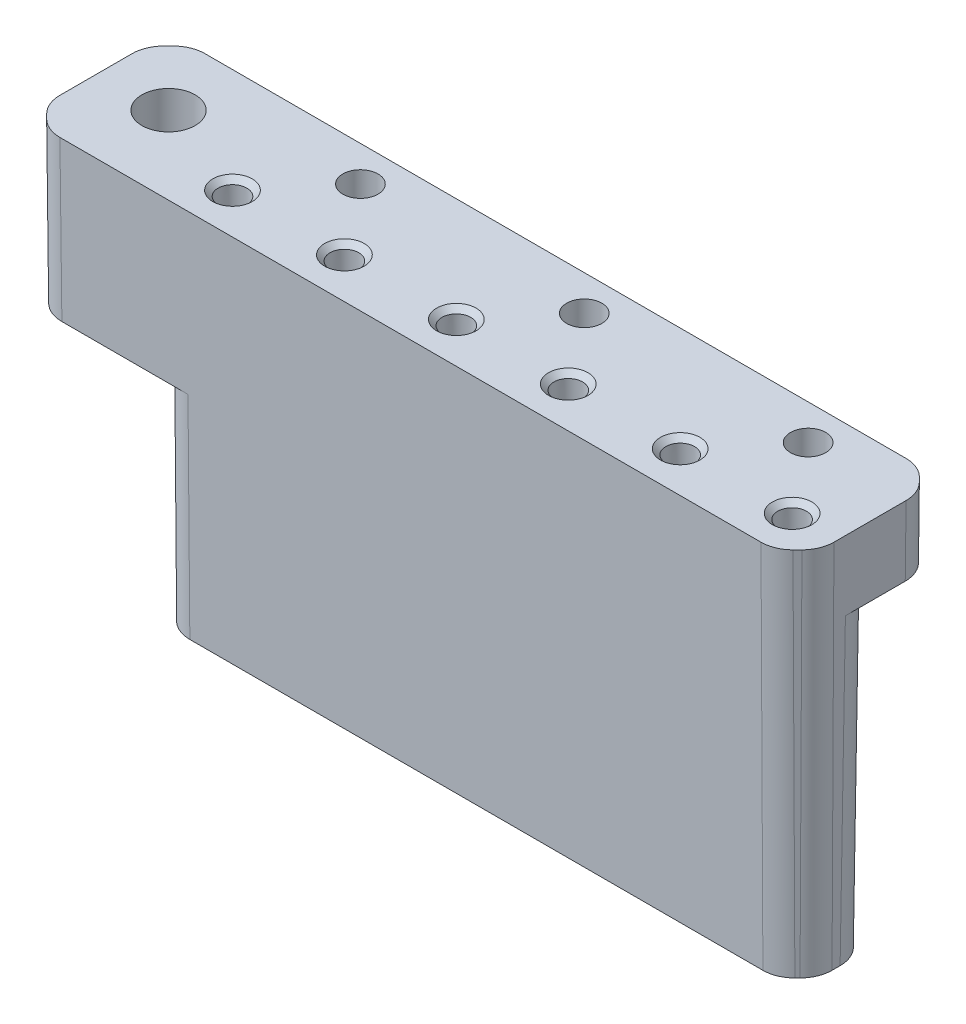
ISO-10303-21;
HEADER;
FILE_DESCRIPTION(('STEP AP214'),'2;1');
FILE_NAME('part.step','',(''),(''),'','','');
FILE_SCHEMA(('AUTOMOTIVE_DESIGN { 1 0 10303 214 1 1 1 1 }'));
ENDSEC;
DATA;
#1=APPLICATION_CONTEXT('core data for automotive mechanical design processes');
#2=APPLICATION_PROTOCOL_DEFINITION('international standard','automotive_design',2000,#1);
#3=PRODUCT_CONTEXT('',#1,'mechanical');
#4=PRODUCT('Part','Part','',(#3));
#5=PRODUCT_RELATED_PRODUCT_CATEGORY('part','',(#4));
#6=PRODUCT_DEFINITION_FORMATION('','',#4);
#7=PRODUCT_DEFINITION_CONTEXT('part definition',#1,'design');
#8=PRODUCT_DEFINITION('design','',#6,#7);
#9=PRODUCT_DEFINITION_SHAPE('','',#8);
#10=(LENGTH_UNIT() NAMED_UNIT(*) SI_UNIT(.MILLI.,.METRE.));
#11=(NAMED_UNIT(*) PLANE_ANGLE_UNIT() SI_UNIT($,.RADIAN.));
#12=(NAMED_UNIT(*) SI_UNIT($,.STERADIAN.) SOLID_ANGLE_UNIT());
#13=UNCERTAINTY_MEASURE_WITH_UNIT(LENGTH_MEASURE(1.E-05),#10,'distance_accuracy_value','');
#14=(GEOMETRIC_REPRESENTATION_CONTEXT(3) GLOBAL_UNCERTAINTY_ASSIGNED_CONTEXT((#13)) GLOBAL_UNIT_ASSIGNED_CONTEXT((#10,
#11,#12)) REPRESENTATION_CONTEXT('',''));
#15=CARTESIAN_POINT('',(0.,0.,0.));
#16=DIRECTION('',(0.,0.,1.));
#17=DIRECTION('',(1.,0.,0.));
#18=AXIS2_PLACEMENT_3D('',#15,#16,#17);
#19=CARTESIAN_POINT('',(0.,0.,13.));
#20=DIRECTION('',(-0.999961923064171,-0.00872653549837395,0.));
#21=DIRECTION('',(0.00872653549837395,-0.999961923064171,0.));
#22=AXIS2_PLACEMENT_3D('',#19,#20,#21);
#23=PLANE('',#22);
#24=DIRECTION('',(0.,0.,-1.));
#25=VECTOR('',#24,1.);
#26=CARTESIAN_POINT('',(-0.174537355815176,20.,13.));
#27=LINE('',#26,#25);
#28=CARTESIAN_POINT('',(-0.174537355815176,20.,3.17029763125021));
#29=VERTEX_POINT('',#28);
#30=CARTESIAN_POINT('',(-0.174537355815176,20.,9.8297023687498));
#31=VERTEX_POINT('',#30);
#32=EDGE_CURVE('E447',#29,#31,#27,.F.);
#33=ORIENTED_EDGE('',*,*,#32,.T.);
#34=DIRECTION('',(-0.00872647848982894,0.999955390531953,0.00361462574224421));
#35=VECTOR('',#34,1.);
#36=CARTESIAN_POINT('',(-0.305479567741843,35.0044913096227,9.88394040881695));
#37=LINE('',#36,#35);
#38=CARTESIAN_POINT('',(-0.305440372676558,35.,9.88392417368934));
#39=VERTEX_POINT('',#38);
#40=EDGE_CURVE('E563',#31,#39,#37,.T.);
#41=ORIENTED_EDGE('',*,*,#40,.T.);
#42=DIRECTION('',(0.,0.,1.));
#43=VECTOR('',#42,1.);
#44=CARTESIAN_POINT('',(-0.305440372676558,35.,13.));
#45=LINE('',#44,#43);
#46=CARTESIAN_POINT('',(-0.305440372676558,35.,3.11607582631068));
#47=VERTEX_POINT('',#46);
#48=EDGE_CURVE('E415',#39,#47,#45,.F.);
#49=ORIENTED_EDGE('',*,*,#48,.T.);
#50=DIRECTION('',(0.00872647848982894,-0.999955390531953,0.00361462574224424));
#51=VECTOR('',#50,1.);
#52=CARTESIAN_POINT('',(-0.174576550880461,20.0044913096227,3.17028139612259));
#53=LINE('',#52,#51);
#54=EDGE_CURVE('E561',#47,#29,#53,.T.);
#55=ORIENTED_EDGE('',*,*,#54,.T.);
#56=EDGE_LOOP('',(#33,#41,#49,#55));
#57=FACE_BOUND('',#56,.T.);
#58=ADVANCED_FACE('F51',(#57),#23,.T.);
#59=CARTESIAN_POINT('',(0.,0.,13.));
#60=DIRECTION('',(0.,1.,0.));
#61=DIRECTION('',(0.,0.,1.));
#62=AXIS2_PLACEMENT_3D('',#59,#60,#61);
#63=PLANE('',#62);
#64=CARTESIAN_POINT('',(68.,0.,9.5));
#65=DIRECTION('',(0.,1.,0.));
#66=DIRECTION('',(0.,0.,1.));
#67=AXIS2_PLACEMENT_3D('',#64,#65,#66);
#68=CIRCLE('',#67,2.59999999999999);
#69=CARTESIAN_POINT('',(68.,0.,12.1));
#70=VERTEX_POINT('',#69);
#71=EDGE_CURVE('E343',#70,#70,#68,.T.);
#72=ORIENTED_EDGE('',*,*,#71,.T.);
#73=EDGE_LOOP('',(#72));
#74=FACE_BOUND('',#73,.T.);
#75=CARTESIAN_POINT('',(57.5,0.,9.5));
#76=DIRECTION('',(0.,1.,0.));
#77=DIRECTION('',(0.,0.,1.));
#78=AXIS2_PLACEMENT_3D('',#75,#76,#77);
#79=CIRCLE('',#78,2.59999999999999);
#80=CARTESIAN_POINT('',(57.5,0.,12.1));
#81=VERTEX_POINT('',#80);
#82=EDGE_CURVE('E340',#81,#81,#79,.T.);
#83=ORIENTED_EDGE('',*,*,#82,.T.);
#84=EDGE_LOOP('',(#83));
#85=FACE_BOUND('',#84,.T.);
#86=CARTESIAN_POINT('',(47.,0.,9.5));
#87=DIRECTION('',(0.,1.,0.));
#88=DIRECTION('',(0.,0.,1.));
#89=AXIS2_PLACEMENT_3D('',#86,#87,#88);
#90=CIRCLE('',#89,2.59999999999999);
#91=CARTESIAN_POINT('',(47.,0.,12.1));
#92=VERTEX_POINT('',#91);
#93=EDGE_CURVE('E337',#92,#92,#90,.T.);
#94=ORIENTED_EDGE('',*,*,#93,.T.);
#95=EDGE_LOOP('',(#94));
#96=FACE_BOUND('',#95,.T.);
#97=CARTESIAN_POINT('',(36.5,0.,9.5));
#98=DIRECTION('',(0.,1.,0.));
#99=DIRECTION('',(0.,0.,1.));
#100=AXIS2_PLACEMENT_3D('',#97,#98,#99);
#101=CIRCLE('',#100,2.59999999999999);
#102=CARTESIAN_POINT('',(36.5,0.,12.1));
#103=VERTEX_POINT('',#102);
#104=EDGE_CURVE('E334',#103,#103,#101,.T.);
#105=ORIENTED_EDGE('',*,*,#104,.T.);
#106=EDGE_LOOP('',(#105));
#107=FACE_BOUND('',#106,.T.);
#108=CARTESIAN_POINT('',(26.,0.,9.5));
#109=DIRECTION('',(0.,1.,0.));
#110=DIRECTION('',(0.,0.,1.));
#111=AXIS2_PLACEMENT_3D('',#108,#109,#110);
#112=CIRCLE('',#111,2.59999999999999);
#113=CARTESIAN_POINT('',(26.,0.,12.1));
#114=VERTEX_POINT('',#113);
#115=EDGE_CURVE('E330',#114,#114,#112,.T.);
#116=ORIENTED_EDGE('',*,*,#115,.T.);
#117=EDGE_LOOP('',(#116));
#118=FACE_BOUND('',#117,.T.);
#119=CARTESIAN_POINT('',(15.5,0.,9.5));
#120=DIRECTION('',(0.,1.,0.));
#121=DIRECTION('',(0.,0.,1.));
#122=AXIS2_PLACEMENT_3D('',#119,#120,#121);
#123=CIRCLE('',#122,2.59999999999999);
#124=CARTESIAN_POINT('',(15.5,0.,12.1));
#125=VERTEX_POINT('',#124);
#126=EDGE_CURVE('E327',#125,#125,#123,.T.);
#127=ORIENTED_EDGE('',*,*,#126,.T.);
#128=EDGE_LOOP('',(#127));
#129=FACE_BOUND('',#128,.T.);
#130=CARTESIAN_POINT('',(21.,0.,9.));
#131=DIRECTION('',(0.,1.,0.));
#132=DIRECTION('',(0.,0.,1.));
#133=AXIS2_PLACEMENT_3D('',#130,#131,#132);
#134=CIRCLE('',#133,1.44999999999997);
#135=CARTESIAN_POINT('',(21.,0.,10.45));
#136=VERTEX_POINT('',#135);
#137=EDGE_CURVE('E291',#136,#136,#134,.T.);
#138=ORIENTED_EDGE('',*,*,#137,.T.);
#139=EDGE_LOOP('',(#138));
#140=FACE_BOUND('',#139,.T.);
#141=CARTESIAN_POINT('',(31.5,0.,9.));
#142=DIRECTION('',(0.,1.,0.));
#143=DIRECTION('',(0.,0.,1.));
#144=AXIS2_PLACEMENT_3D('',#141,#142,#143);
#145=CIRCLE('',#144,1.44999999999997);
#146=CARTESIAN_POINT('',(31.5,0.,10.45));
#147=VERTEX_POINT('',#146);
#148=EDGE_CURVE('E288',#147,#147,#145,.T.);
#149=ORIENTED_EDGE('',*,*,#148,.T.);
#150=EDGE_LOOP('',(#149));
#151=FACE_BOUND('',#150,.T.);
#152=CARTESIAN_POINT('',(42.,0.,9.));
#153=DIRECTION('',(0.,1.,0.));
#154=DIRECTION('',(0.,0.,1.));
#155=AXIS2_PLACEMENT_3D('',#152,#153,#154);
#156=CIRCLE('',#155,1.44999999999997);
#157=CARTESIAN_POINT('',(42.,0.,10.45));
#158=VERTEX_POINT('',#157);
#159=EDGE_CURVE('E285',#158,#158,#156,.T.);
#160=ORIENTED_EDGE('',*,*,#159,.T.);
#161=EDGE_LOOP('',(#160));
#162=FACE_BOUND('',#161,.T.);
#163=CARTESIAN_POINT('',(52.5,0.,9.));
#164=DIRECTION('',(0.,1.,0.));
#165=DIRECTION('',(0.,0.,1.));
#166=AXIS2_PLACEMENT_3D('',#163,#164,#165);
#167=CIRCLE('',#166,1.44999999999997);
#168=CARTESIAN_POINT('',(52.5,0.,10.45));
#169=VERTEX_POINT('',#168);
#170=EDGE_CURVE('E282',#169,#169,#167,.T.);
#171=ORIENTED_EDGE('',*,*,#170,.T.);
#172=EDGE_LOOP('',(#171));
#173=FACE_BOUND('',#172,.T.);
#174=CARTESIAN_POINT('',(63.,0.,9.));
#175=DIRECTION('',(0.,1.,0.));
#176=DIRECTION('',(0.,0.,1.));
#177=AXIS2_PLACEMENT_3D('',#174,#175,#176);
#178=CIRCLE('',#177,1.44999999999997);
#179=CARTESIAN_POINT('',(63.,0.,10.45));
#180=VERTEX_POINT('',#179);
#181=EDGE_CURVE('E278',#180,#180,#178,.T.);
#182=ORIENTED_EDGE('',*,*,#181,.T.);
#183=EDGE_LOOP('',(#182));
#184=FACE_BOUND('',#183,.T.);
#185=DIRECTION('',(-1.,0.,0.));
#186=VECTOR('',#185,1.);
#187=CARTESIAN_POINT('',(0.,0.,6.));
#188=LINE('',#187,#186);
#189=CARTESIAN_POINT('',(15.,0.,6.));
#190=VERTEX_POINT('',#189);
#191=CARTESIAN_POINT('',(69.0001142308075,0.,6.));
#192=VERTEX_POINT('',#191);
#193=EDGE_CURVE('E363',#190,#192,#188,.F.);
#194=ORIENTED_EDGE('',*,*,#193,.T.);
#195=CARTESIAN_POINT('',(68.9998857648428,0.,9.00011423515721));
#196=DIRECTION('',(0.,1.,0.));
#197=DIRECTION('',(0.707106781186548,0.,-0.707106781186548));
#198=AXIS2_PLACEMENT_3D('',#195,#196,#197);
#199=ELLIPSE('',#198,3.00022846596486,3.);
#200=CARTESIAN_POINT('',(72.,0.,8.99988576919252));
#201=VERTEX_POINT('',#200);
#202=EDGE_CURVE('E532',#192,#201,#199,.F.);
#203=ORIENTED_EDGE('',*,*,#202,.T.);
#204=DIRECTION('',(0.,0.,1.));
#205=VECTOR('',#204,1.);
#206=CARTESIAN_POINT('',(72.,0.,13.));
#207=LINE('',#206,#205);
#208=CARTESIAN_POINT('',(72.,0.,9.75740662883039));
#209=VERTEX_POINT('',#208);
#210=EDGE_CURVE('E274',#209,#201,#207,.F.);
#211=ORIENTED_EDGE('',*,*,#210,.F.);
#212=CARTESIAN_POINT('',(68.9998857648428,0.,9.75731199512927));
#213=DIRECTION('',(0.,1.,0.));
#214=DIRECTION('',(-0.923879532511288,0.,-0.382683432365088));
#215=AXIS2_PLACEMENT_3D('',#212,#213,#214);
#216=ELLIPSE('',#215,3.00013383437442,3.);
#217=CARTESIAN_POINT('',(71.1213538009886,0.,11.8786461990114));
#218=VERTEX_POINT('',#217);
#219=EDGE_CURVE('E530',#209,#218,#216,.F.);
#220=ORIENTED_EDGE('',*,*,#219,.T.);
#221=DIRECTION('',(-0.707106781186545,0.,0.70710678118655));
#222=VECTOR('',#221,1.);
#223=CARTESIAN_POINT('',(35.0000000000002,0.,48.));
#224=LINE('',#223,#222);
#225=CARTESIAN_POINT('',(70.8786461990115,0.,12.1213538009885));
#226=VERTEX_POINT('',#225);
#227=EDGE_CURVE('E306',#218,#226,#224,.T.);
#228=ORIENTED_EDGE('',*,*,#227,.T.);
#229=CARTESIAN_POINT('',(68.7573119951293,0.,9.99988576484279));
#230=DIRECTION('',(0.,1.,0.));
#231=DIRECTION('',(0.382683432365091,0.,0.923879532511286));
#232=AXIS2_PLACEMENT_3D('',#229,#230,#231);
#233=ELLIPSE('',#232,3.00013383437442,3.);
#234=CARTESIAN_POINT('',(68.7574066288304,0.,13.));
#235=VERTEX_POINT('',#234);
#236=EDGE_CURVE('E528',#226,#235,#233,.F.);
#237=ORIENTED_EDGE('',*,*,#236,.T.);
#238=DIRECTION('',(-1.,0.,0.));
#239=VECTOR('',#238,1.);
#240=CARTESIAN_POINT('',(0.,0.,13.));
#241=LINE('',#240,#239);
#242=CARTESIAN_POINT('',(15.,0.,13.));
#243=VERTEX_POINT('',#242);
#244=EDGE_CURVE('E422',#243,#235,#241,.F.);
#245=ORIENTED_EDGE('',*,*,#244,.F.);
#246=CARTESIAN_POINT('',(15.,0.,9.99988576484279));
#247=DIRECTION('',(0.,1.,0.));
#248=DIRECTION('',(0.,0.,1.));
#249=AXIS2_PLACEMENT_3D('',#246,#247,#248);
#250=ELLIPSE('',#249,3.00011423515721,3.);
#251=CARTESIAN_POINT('',(12.,0.,9.99988576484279));
#252=VERTEX_POINT('',#251);
#253=EDGE_CURVE('E526',#243,#252,#250,.F.);
#254=ORIENTED_EDGE('',*,*,#253,.T.);
#255=DIRECTION('',(0.,0.,-1.));
#256=VECTOR('',#255,1.);
#257=CARTESIAN_POINT('',(12.,0.,13.));
#258=LINE('',#257,#256);
#259=CARTESIAN_POINT('',(12.,0.,9.00011423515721));
#260=VERTEX_POINT('',#259);
#261=EDGE_CURVE('E443',#252,#260,#258,.T.);
#262=ORIENTED_EDGE('',*,*,#261,.T.);
#263=CARTESIAN_POINT('',(15.,0.,9.00011423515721));
#264=DIRECTION('',(0.,1.,0.));
#265=DIRECTION('',(0.,0.,1.));
#266=AXIS2_PLACEMENT_3D('',#263,#264,#265);
#267=ELLIPSE('',#266,3.00011423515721,3.);
#268=EDGE_CURVE('E524',#260,#190,#267,.F.);
#269=ORIENTED_EDGE('',*,*,#268,.T.);
#270=EDGE_LOOP('',(#194,#203,#211,#220,#228,#237,#245,#254,#262,#269));
#271=FACE_BOUND('',#270,.T.);
#272=ADVANCED_FACE('F587',(#74,#85,#96,#107,#118,#129,#140,#151,#162,#173,#184,#271),#63,.F.);
#273=CARTESIAN_POINT('',(72.,0.,13.));
#274=DIRECTION('',(0.999961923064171,-0.00872653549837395,0.));
#275=DIRECTION('',(0.00872653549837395,0.999961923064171,0.));
#276=AXIS2_PLACEMENT_3D('',#273,#274,#275);
#277=PLANE('',#276);
#278=DIRECTION('',(0.,0.,1.));
#279=VECTOR('',#278,1.);
#280=CARTESIAN_POINT('',(72.2480863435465,28.4278792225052,13.));
#281=LINE('',#280,#279);
#282=CARTESIAN_POINT('',(72.2480863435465,28.4278792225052,8.75179942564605));
#283=VERTEX_POINT('',#282);
#284=CARTESIAN_POINT('',(72.2480863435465,28.4278792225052,3.13983264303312));
#285=VERTEX_POINT('',#284);
#286=EDGE_CURVE('E398',#283,#285,#281,.F.);
#287=ORIENTED_EDGE('',*,*,#286,.T.);
#288=DIRECTION('',(0.00872647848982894,0.999955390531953,-0.00361462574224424));
#289=VECTOR('',#288,1.);
#290=CARTESIAN_POINT('',(72.3054795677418,35.0044913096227,3.11605959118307));
#291=LINE('',#290,#289);
#292=CARTESIAN_POINT('',(72.3054403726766,35.,3.1160758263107));
#293=VERTEX_POINT('',#292);
#294=EDGE_CURVE('E516',#285,#293,#291,.T.);
#295=ORIENTED_EDGE('',*,*,#294,.T.);
#296=DIRECTION('',(0.,0.,1.));
#297=VECTOR('',#296,1.);
#298=CARTESIAN_POINT('',(72.3054403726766,35.,13.));
#299=LINE('',#298,#297);
#300=CARTESIAN_POINT('',(72.3054403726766,35.,9.88392417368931));
#301=VERTEX_POINT('',#300);
#302=EDGE_CURVE('E412',#301,#293,#299,.F.);
#303=ORIENTED_EDGE('',*,*,#302,.F.);
#304=DIRECTION('',(-0.00872647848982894,-0.999955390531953,-0.00361462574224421));
#305=VECTOR('',#304,1.);
#306=CARTESIAN_POINT('',(72.0000391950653,0.00449130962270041,9.75742286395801));
#307=LINE('',#306,#305);
#308=EDGE_CURVE('E510',#301,#209,#307,.T.);
#309=ORIENTED_EDGE('',*,*,#308,.T.);
#310=ORIENTED_EDGE('',*,*,#210,.T.);
#311=DIRECTION('',(-0.00872620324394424,-0.999923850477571,0.00872620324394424));
#312=VECTOR('',#311,1.);
#313=CARTESIAN_POINT('',(71.9996954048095,-0.0349031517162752,9.00019036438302));
#314=LINE('',#313,#312);
#315=EDGE_CURVE('E513',#201,#283,#314,.F.);
#316=ORIENTED_EDGE('',*,*,#315,.T.);
#317=EDGE_LOOP('',(#287,#295,#303,#309,#310,#316));
#318=FACE_BOUND('',#317,.T.);
#319=ADVANCED_FACE('F650',(#318),#277,.T.);
#320=CARTESIAN_POINT('',(0.,35.,13.));
#321=DIRECTION('',(0.,-1.,0.));
#322=DIRECTION('',(0.,0.,-1.));
#323=AXIS2_PLACEMENT_3D('',#320,#321,#322);
#324=PLANE('',#323);
#325=CARTESIAN_POINT('',(68.,35.,9.5));
#326=DIRECTION('',(0.,-1.,0.));
#327=DIRECTION('',(0.,0.,-1.));
#328=AXIS2_PLACEMENT_3D('',#325,#326,#327);
#329=CIRCLE('',#328,1.84999999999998);
#330=CARTESIAN_POINT('',(68.,35.,7.65000000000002));
#331=VERTEX_POINT('',#330);
#332=EDGE_CURVE('E323',#331,#331,#329,.T.);
#333=ORIENTED_EDGE('',*,*,#332,.T.);
#334=EDGE_LOOP('',(#333));
#335=FACE_BOUND('',#334,.T.);
#336=CARTESIAN_POINT('',(57.5,35.,9.5));
#337=DIRECTION('',(0.,-1.,0.));
#338=DIRECTION('',(0.,0.,-1.));
#339=AXIS2_PLACEMENT_3D('',#336,#337,#338);
#340=CIRCLE('',#339,1.85);
#341=CARTESIAN_POINT('',(57.5,35.,7.65));
#342=VERTEX_POINT('',#341);
#343=EDGE_CURVE('E320',#342,#342,#340,.T.);
#344=ORIENTED_EDGE('',*,*,#343,.T.);
#345=EDGE_LOOP('',(#344));
#346=FACE_BOUND('',#345,.T.);
#347=CARTESIAN_POINT('',(47.,35.,9.5));
#348=DIRECTION('',(0.,-1.,0.));
#349=DIRECTION('',(0.,0.,-1.));
#350=AXIS2_PLACEMENT_3D('',#347,#348,#349);
#351=CIRCLE('',#350,1.84999999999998);
#352=CARTESIAN_POINT('',(47.,35.,7.65000000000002));
#353=VERTEX_POINT('',#352);
#354=EDGE_CURVE('E317',#353,#353,#351,.T.);
#355=ORIENTED_EDGE('',*,*,#354,.T.);
#356=EDGE_LOOP('',(#355));
#357=FACE_BOUND('',#356,.T.);
#358=CARTESIAN_POINT('',(36.5,35.,9.5));
#359=DIRECTION('',(0.,-1.,0.));
#360=DIRECTION('',(0.,0.,-1.));
#361=AXIS2_PLACEMENT_3D('',#358,#359,#360);
#362=CIRCLE('',#361,1.84999999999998);
#363=CARTESIAN_POINT('',(36.5,35.,7.65000000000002));
#364=VERTEX_POINT('',#363);
#365=EDGE_CURVE('E314',#364,#364,#362,.T.);
#366=ORIENTED_EDGE('',*,*,#365,.T.);
#367=EDGE_LOOP('',(#366));
#368=FACE_BOUND('',#367,.T.);
#369=CARTESIAN_POINT('',(26.,35.,9.5));
#370=DIRECTION('',(0.,-1.,0.));
#371=DIRECTION('',(0.,0.,-1.));
#372=AXIS2_PLACEMENT_3D('',#369,#370,#371);
#373=CIRCLE('',#372,1.84999999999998);
#374=CARTESIAN_POINT('',(26.,35.,7.65000000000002));
#375=VERTEX_POINT('',#374);
#376=EDGE_CURVE('E310',#375,#375,#373,.T.);
#377=ORIENTED_EDGE('',*,*,#376,.T.);
#378=EDGE_LOOP('',(#377));
#379=FACE_BOUND('',#378,.T.);
#380=CARTESIAN_POINT('',(15.5,35.,9.5));
#381=DIRECTION('',(0.,-1.,0.));
#382=DIRECTION('',(0.,0.,-1.));
#383=AXIS2_PLACEMENT_3D('',#380,#381,#382);
#384=CIRCLE('',#383,1.84999999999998);
#385=CARTESIAN_POINT('',(15.5,35.,7.65000000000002));
#386=VERTEX_POINT('',#385);
#387=EDGE_CURVE('E307',#386,#386,#384,.T.);
#388=ORIENTED_EDGE('',*,*,#387,.T.);
#389=EDGE_LOOP('',(#388));
#390=FACE_BOUND('',#389,.T.);
#391=CARTESIAN_POINT('',(42.,35.,3.));
#392=DIRECTION('',(0.,1.,0.));
#393=DIRECTION('',(0.,0.,1.));
#394=AXIS2_PLACEMENT_3D('',#391,#392,#393);
#395=CIRCLE('',#394,1.65);
#396=CARTESIAN_POINT('',(42.,35.,4.65));
#397=VERTEX_POINT('',#396);
#398=EDGE_CURVE('E259',#397,#397,#395,.T.);
#399=ORIENTED_EDGE('',*,*,#398,.F.);
#400=EDGE_LOOP('',(#399));
#401=FACE_BOUND('',#400,.T.);
#402=CARTESIAN_POINT('',(21.,35.,3.));
#403=DIRECTION('',(0.,1.,0.));
#404=DIRECTION('',(0.,0.,1.));
#405=AXIS2_PLACEMENT_3D('',#402,#403,#404);
#406=CIRCLE('',#405,1.65);
#407=CARTESIAN_POINT('',(21.,35.,4.65));
#408=VERTEX_POINT('',#407);
#409=EDGE_CURVE('E262',#408,#408,#406,.T.);
#410=ORIENTED_EDGE('',*,*,#409,.F.);
#411=EDGE_LOOP('',(#410));
#412=FACE_BOUND('',#411,.T.);
#413=CARTESIAN_POINT('',(6.,35.,6.));
#414=DIRECTION('',(0.,1.,0.));
#415=DIRECTION('',(0.,0.,1.));
#416=AXIS2_PLACEMENT_3D('',#413,#414,#415);
#417=CIRCLE('',#416,2.49999999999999);
#418=CARTESIAN_POINT('',(6.,35.,8.49999999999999));
#419=VERTEX_POINT('',#418);
#420=EDGE_CURVE('E266',#419,#419,#417,.T.);
#421=ORIENTED_EDGE('',*,*,#420,.F.);
#422=EDGE_LOOP('',(#421));
#423=FACE_BOUND('',#422,.T.);
#424=DIRECTION('',(-0.707106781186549,0.,-0.707106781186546));
#425=VECTOR('',#424,1.);
#426=CARTESIAN_POINT('',(41.7159789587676,35.,-28.7159789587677));
#427=LINE('',#426,#425);
#428=CARTESIAN_POINT('',(71.4267941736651,35.,0.994836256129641));
#429=VERTEX_POINT('',#428);
#430=CARTESIAN_POINT('',(71.0051637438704,35.,0.57320582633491));
#431=VERTEX_POINT('',#430);
#432=EDGE_CURVE('E416',#429,#431,#427,.T.);
#433=ORIENTED_EDGE('',*,*,#432,.T.);
#434=CARTESIAN_POINT('',(68.8838295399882,35.,2.69467386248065));
#435=DIRECTION('',(0.,-1.,0.));
#436=DIRECTION('',(-0.382683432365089,0.,0.923879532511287));
#437=AXIS2_PLACEMENT_3D('',#434,#435,#436);
#438=ELLIPSE('',#437,3.00013383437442,3.);
#439=CARTESIAN_POINT('',(68.8839241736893,35.,-0.305440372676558));
#440=VERTEX_POINT('',#439);
#441=EDGE_CURVE('E508',#431,#440,#438,.F.);
#442=ORIENTED_EDGE('',*,*,#441,.T.);
#443=DIRECTION('',(-1.,0.,0.));
#444=VECTOR('',#443,1.);
#445=CARTESIAN_POINT('',(0.,35.,-0.305440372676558));
#446=LINE('',#445,#444);
#447=CARTESIAN_POINT('',(3.11607582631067,35.,-0.305440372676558));
#448=VERTEX_POINT('',#447);
#449=EDGE_CURVE('E269',#440,#448,#446,.T.);
#450=ORIENTED_EDGE('',*,*,#449,.T.);
#451=CARTESIAN_POINT('',(3.11617046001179,35.,2.69467386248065));
#452=DIRECTION('',(0.,-1.,0.));
#453=DIRECTION('',(-0.382683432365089,0.,-0.923879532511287));
#454=AXIS2_PLACEMENT_3D('',#451,#452,#453);
#455=ELLIPSE('',#454,3.00013383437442,3.);
#456=CARTESIAN_POINT('',(0.994836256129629,35.,0.573205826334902));
#457=VERTEX_POINT('',#456);
#458=EDGE_CURVE('E494',#448,#457,#455,.F.);
#459=ORIENTED_EDGE('',*,*,#458,.T.);
#460=DIRECTION('',(-0.707106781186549,0.,0.707106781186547));
#461=VECTOR('',#460,1.);
#462=CARTESIAN_POINT('',(-5.71597895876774,35.,7.28402104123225));
#463=LINE('',#462,#461);
#464=CARTESIAN_POINT('',(0.57320582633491,35.,0.994836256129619));
#465=VERTEX_POINT('',#464);
#466=EDGE_CURVE('E385',#457,#465,#463,.T.);
#467=ORIENTED_EDGE('',*,*,#466,.T.);
#468=CARTESIAN_POINT('',(2.69467386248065,35.,3.11617046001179));
#469=DIRECTION('',(0.,-1.,0.));
#470=DIRECTION('',(0.923879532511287,0.,0.38268343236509));
#471=AXIS2_PLACEMENT_3D('',#468,#469,#470);
#472=ELLIPSE('',#471,3.00013383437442,3.);
#473=EDGE_CURVE('E496',#465,#47,#472,.F.);
#474=ORIENTED_EDGE('',*,*,#473,.T.);
#475=ORIENTED_EDGE('',*,*,#48,.F.);
#476=CARTESIAN_POINT('',(2.69467386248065,35.,9.88382953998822));
#477=DIRECTION('',(0.,-1.,0.));
#478=DIRECTION('',(-0.923879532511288,0.,0.382683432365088));
#479=AXIS2_PLACEMENT_3D('',#476,#477,#478);
#480=ELLIPSE('',#479,3.00013383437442,3.);
#481=CARTESIAN_POINT('',(0.573205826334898,35.,12.0051637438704));
#482=VERTEX_POINT('',#481);
#483=EDGE_CURVE('E498',#39,#482,#480,.F.);
#484=ORIENTED_EDGE('',*,*,#483,.T.);
#485=DIRECTION('',(0.707106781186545,0.,0.70710678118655));
#486=VECTOR('',#485,1.);
#487=CARTESIAN_POINT('',(0.784021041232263,35.,12.2159789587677));
#488=LINE('',#487,#486);
#489=CARTESIAN_POINT('',(0.994836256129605,35.,12.4267941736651));
#490=VERTEX_POINT('',#489);
#491=EDGE_CURVE('E428',#482,#490,#488,.T.);
#492=ORIENTED_EDGE('',*,*,#491,.T.);
#493=CARTESIAN_POINT('',(3.11617046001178,35.,10.3053261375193));
#494=DIRECTION('',(0.,-1.,0.));
#495=DIRECTION('',(0.382683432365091,0.,-0.923879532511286));
#496=AXIS2_PLACEMENT_3D('',#493,#494,#495);
#497=ELLIPSE('',#496,3.00013383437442,3.);
#498=CARTESIAN_POINT('',(3.11607582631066,35.,13.3054403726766));
#499=VERTEX_POINT('',#498);
#500=EDGE_CURVE('E500',#490,#499,#497,.F.);
#501=ORIENTED_EDGE('',*,*,#500,.T.);
#502=DIRECTION('',(1.,0.,0.));
#503=VECTOR('',#502,1.);
#504=CARTESIAN_POINT('',(0.,35.,13.3054403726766));
#505=LINE('',#504,#503);
#506=CARTESIAN_POINT('',(68.8839241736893,35.,13.3054403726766));
#507=VERTEX_POINT('',#506);
#508=EDGE_CURVE('E427',#507,#499,#505,.F.);
#509=ORIENTED_EDGE('',*,*,#508,.F.);
#510=CARTESIAN_POINT('',(68.8838295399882,35.,10.3053261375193));
#511=DIRECTION('',(0.,-1.,0.));
#512=DIRECTION('',(0.382683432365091,0.,0.923879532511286));
#513=AXIS2_PLACEMENT_3D('',#510,#511,#512);
#514=ELLIPSE('',#513,3.00013383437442,3.);
#515=CARTESIAN_POINT('',(71.0051637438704,35.,12.4267941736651));
#516=VERTEX_POINT('',#515);
#517=EDGE_CURVE('E502',#507,#516,#514,.F.);
#518=ORIENTED_EDGE('',*,*,#517,.T.);
#519=DIRECTION('',(0.707106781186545,0.,-0.70710678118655));
#520=VECTOR('',#519,1.);
#521=CARTESIAN_POINT('',(35.215978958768,35.,48.2159789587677));
#522=LINE('',#521,#520);
#523=CARTESIAN_POINT('',(71.4267941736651,35.,12.0051637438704));
#524=VERTEX_POINT('',#523);
#525=EDGE_CURVE('E419',#516,#524,#522,.T.);
#526=ORIENTED_EDGE('',*,*,#525,.T.);
#527=CARTESIAN_POINT('',(69.3053261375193,35.,9.8838295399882));
#528=DIRECTION('',(0.,-1.,0.));
#529=DIRECTION('',(-0.923879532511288,0.,-0.382683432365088));
#530=AXIS2_PLACEMENT_3D('',#527,#528,#529);
#531=ELLIPSE('',#530,3.00013383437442,3.);
#532=EDGE_CURVE('E504',#524,#301,#531,.F.);
#533=ORIENTED_EDGE('',*,*,#532,.T.);
#534=ORIENTED_EDGE('',*,*,#302,.T.);
#535=CARTESIAN_POINT('',(69.3053261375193,35.,3.11617046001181));
#536=DIRECTION('',(0.,-1.,0.));
#537=DIRECTION('',(0.923879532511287,0.,-0.38268343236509));
#538=AXIS2_PLACEMENT_3D('',#535,#536,#537);
#539=ELLIPSE('',#538,3.00013383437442,3.);
#540=EDGE_CURVE('E506',#293,#429,#539,.F.);
#541=ORIENTED_EDGE('',*,*,#540,.T.);
#542=EDGE_LOOP('',(#433,#442,#450,#459,#467,#474,#475,#484,#492,#501,#509,#518,#526,#533,#534,#541));
#543=FACE_BOUND('',#542,.T.);
#544=CARTESIAN_POINT('',(63.,35.,3.));
#545=DIRECTION('',(0.,1.,0.));
#546=DIRECTION('',(0.,0.,1.));
#547=AXIS2_PLACEMENT_3D('',#544,#545,#546);
#548=CIRCLE('',#547,1.65);
#549=CARTESIAN_POINT('',(63.,35.,4.65));
#550=VERTEX_POINT('',#549);
#551=EDGE_CURVE('E270',#550,#550,#548,.T.);
#552=ORIENTED_EDGE('',*,*,#551,.F.);
#553=EDGE_LOOP('',(#552));
#554=FACE_BOUND('',#553,.T.);
#555=ADVANCED_FACE('F598',(#335,#346,#357,#368,#379,#390,#401,#412,#423,#543,#554),#324,.F.);
#556=CARTESIAN_POINT('',(0.,0.,13.));
#557=DIRECTION('',(0.,-0.00872653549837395,0.999961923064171));
#558=DIRECTION('',(0.,-0.999961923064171,-0.00872653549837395));
#559=AXIS2_PLACEMENT_3D('',#556,#557,#558);
#560=PLANE('',#559);
#561=ORIENTED_EDGE('',*,*,#244,.T.);
#562=DIRECTION('',(0.00361462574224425,0.999955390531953,0.00872647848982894));
#563=VECTOR('',#562,1.);
#564=CARTESIAN_POINT('',(68.8839404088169,35.0044913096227,13.3054795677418));
#565=LINE('',#564,#563);
#566=EDGE_CURVE('E544',#235,#507,#565,.T.);
#567=ORIENTED_EDGE('',*,*,#566,.T.);
#568=ORIENTED_EDGE('',*,*,#508,.T.);
#569=DIRECTION('',(0.00361462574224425,-0.999955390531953,-0.00872647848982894));
#570=VECTOR('',#569,1.);
#571=CARTESIAN_POINT('',(3.17028139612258,20.0044913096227,13.1745765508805));
#572=LINE('',#571,#570);
#573=CARTESIAN_POINT('',(3.1702976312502,20.,13.1745373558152));
#574=VERTEX_POINT('',#573);
#575=EDGE_CURVE('E538',#499,#574,#572,.T.);
#576=ORIENTED_EDGE('',*,*,#575,.T.);
#577=DIRECTION('',(-1.,0.,0.));
#578=VECTOR('',#577,1.);
#579=CARTESIAN_POINT('',(0.,20.,13.1745373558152));
#580=LINE('',#579,#578);
#581=CARTESIAN_POINT('',(15.,20.,13.1745373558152));
#582=VERTEX_POINT('',#581);
#583=EDGE_CURVE('E441',#574,#582,#580,.F.);
#584=ORIENTED_EDGE('',*,*,#583,.T.);
#585=DIRECTION('',(0.,-0.999961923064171,-0.00872653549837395));
#586=VECTOR('',#585,1.);
#587=CARTESIAN_POINT('',(15.,0.,13.));
#588=LINE('',#587,#586);
#589=EDGE_CURVE('E541',#582,#243,#588,.T.);
#590=ORIENTED_EDGE('',*,*,#589,.T.);
#591=EDGE_LOOP('',(#561,#567,#568,#576,#584,#590));
#592=FACE_BOUND('',#591,.T.);
#593=ADVANCED_FACE('F584',(#592),#560,.T.);
#594=CARTESIAN_POINT('',(0.,0.,0.));
#595=DIRECTION('',(0.,-0.00872653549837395,-0.999961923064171));
#596=DIRECTION('',(0.,0.999961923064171,-0.00872653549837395));
#597=AXIS2_PLACEMENT_3D('',#594,#595,#596);
#598=PLANE('',#597);
#599=ORIENTED_EDGE('',*,*,#449,.F.);
#600=DIRECTION('',(-0.00361462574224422,-0.999955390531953,0.00872647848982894));
#601=VECTOR('',#600,1.);
#602=CARTESIAN_POINT('',(68.75650827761,-0.248521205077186,0.00216881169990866));
#603=LINE('',#602,#601);
#604=CARTESIAN_POINT('',(68.8601673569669,28.4278792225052,-0.248086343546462));
#605=VERTEX_POINT('',#604);
#606=EDGE_CURVE('E483',#440,#605,#603,.T.);
#607=ORIENTED_EDGE('',*,*,#606,.T.);
#608=DIRECTION('',(1.,0.,0.));
#609=VECTOR('',#608,1.);
#610=CARTESIAN_POINT('',(0.,28.4278792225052,-0.248086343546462));
#611=LINE('',#610,#609);
#612=CARTESIAN_POINT('',(10.2480863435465,28.4278792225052,-0.248086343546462));
#613=VERTEX_POINT('',#612);
#614=EDGE_CURVE('E394',#613,#605,#611,.T.);
#615=ORIENTED_EDGE('',*,*,#614,.F.);
#616=DIRECTION('',(-0.00872620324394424,-0.99992385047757,0.00872620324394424));
#617=VECTOR('',#616,1.);
#618=CARTESIAN_POINT('',(9.99923853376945,-0.0872553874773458,0.000761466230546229));
#619=LINE('',#618,#617);
#620=CARTESIAN_POINT('',(10.1745373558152,20.,-0.174537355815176));
#621=VERTEX_POINT('',#620);
#622=EDGE_CURVE('E395',#621,#613,#619,.F.);
#623=ORIENTED_EDGE('',*,*,#622,.F.);
#624=DIRECTION('',(1.,0.,0.));
#625=VECTOR('',#624,1.);
#626=CARTESIAN_POINT('',(0.,20.,-0.174537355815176));
#627=LINE('',#626,#625);
#628=CARTESIAN_POINT('',(3.17029763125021,20.,-0.174537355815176));
#629=VERTEX_POINT('',#628);
#630=EDGE_CURVE('E444',#629,#621,#627,.T.);
#631=ORIENTED_EDGE('',*,*,#630,.F.);
#632=DIRECTION('',(-0.00361462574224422,0.999955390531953,-0.00872647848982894));
#633=VECTOR('',#632,1.);
#634=CARTESIAN_POINT('',(3.24255100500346,0.0117202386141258,-0.000102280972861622));
#635=LINE('',#634,#633);
#636=EDGE_CURVE('E456',#629,#448,#635,.T.);
#637=ORIENTED_EDGE('',*,*,#636,.T.);
#638=EDGE_LOOP('',(#599,#607,#615,#623,#631,#637));
#639=FACE_BOUND('',#638,.T.);
#640=ADVANCED_FACE('F629',(#639),#598,.T.);
#641=CARTESIAN_POINT('',(6.,35.,6.));
#642=DIRECTION('',(0.,1.,0.));
#643=DIRECTION('',(0.,0.,1.));
#644=AXIS2_PLACEMENT_3D('',#641,#642,#643);
#645=CYLINDRICAL_SURFACE('',#644,2.49999999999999);
#646=CARTESIAN_POINT('',(6.,20.,6.));
#647=DIRECTION('',(0.,1.,0.));
#648=DIRECTION('',(0.,0.,1.));
#649=AXIS2_PLACEMENT_3D('',#646,#647,#648);
#650=CIRCLE('',#649,2.49999999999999);
#651=CARTESIAN_POINT('',(6.,20.,8.49999999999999));
#652=VERTEX_POINT('',#651);
#653=EDGE_CURVE('E397',#652,#652,#650,.F.);
#654=ORIENTED_EDGE('',*,*,#653,.T.);
#655=EDGE_LOOP('',(#654));
#656=FACE_BOUND('',#655,.T.);
#657=ORIENTED_EDGE('',*,*,#420,.T.);
#658=EDGE_LOOP('',(#657));
#659=FACE_BOUND('',#658,.T.);
#660=ADVANCED_FACE('F698',(#656,#659),#645,.F.);
#661=CARTESIAN_POINT('',(21.,35.,3.));
#662=DIRECTION('',(0.,1.,0.));
#663=DIRECTION('',(0.,0.,1.));
#664=AXIS2_PLACEMENT_3D('',#661,#662,#663);
#665=CYLINDRICAL_SURFACE('',#664,1.65);
#666=CARTESIAN_POINT('',(21.,28.4278792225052,3.));
#667=DIRECTION('',(0.,1.,0.));
#668=DIRECTION('',(0.,0.,1.));
#669=AXIS2_PLACEMENT_3D('',#666,#667,#668);
#670=CIRCLE('',#669,1.65);
#671=CARTESIAN_POINT('',(21.,28.4278792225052,4.65));
#672=VERTEX_POINT('',#671);
#673=EDGE_CURVE('E247',#672,#672,#670,.F.);
#674=ORIENTED_EDGE('',*,*,#673,.T.);
#675=EDGE_LOOP('',(#674));
#676=FACE_BOUND('',#675,.T.);
#677=ORIENTED_EDGE('',*,*,#409,.T.);
#678=EDGE_LOOP('',(#677));
#679=FACE_BOUND('',#678,.T.);
#680=ADVANCED_FACE('F1085',(#676,#679),#665,.F.);
#681=CARTESIAN_POINT('',(42.,35.,3.));
#682=DIRECTION('',(0.,1.,0.));
#683=DIRECTION('',(0.,0.,1.));
#684=AXIS2_PLACEMENT_3D('',#681,#682,#683);
#685=CYLINDRICAL_SURFACE('',#684,1.65);
#686=CARTESIAN_POINT('',(42.,28.4278792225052,3.));
#687=DIRECTION('',(0.,1.,0.));
#688=DIRECTION('',(0.,0.,1.));
#689=AXIS2_PLACEMENT_3D('',#686,#687,#688);
#690=CIRCLE('',#689,1.65);
#691=CARTESIAN_POINT('',(42.,28.4278792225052,4.65));
#692=VERTEX_POINT('',#691);
#693=EDGE_CURVE('E1078',#692,#692,#690,.F.);
#694=ORIENTED_EDGE('',*,*,#693,.T.);
#695=EDGE_LOOP('',(#694));
#696=FACE_BOUND('',#695,.T.);
#697=ORIENTED_EDGE('',*,*,#398,.T.);
#698=EDGE_LOOP('',(#697));
#699=FACE_BOUND('',#698,.T.);
#700=ADVANCED_FACE('F725',(#696,#699),#685,.F.);
#701=CARTESIAN_POINT('',(63.,35.,3.));
#702=DIRECTION('',(0.,1.,0.));
#703=DIRECTION('',(0.,0.,1.));
#704=AXIS2_PLACEMENT_3D('',#701,#702,#703);
#705=CYLINDRICAL_SURFACE('',#704,1.65);
#706=CARTESIAN_POINT('',(63.,28.4278792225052,3.));
#707=DIRECTION('',(0.,1.,0.));
#708=DIRECTION('',(0.,0.,1.));
#709=AXIS2_PLACEMENT_3D('',#706,#707,#708);
#710=CIRCLE('',#709,1.65);
#711=CARTESIAN_POINT('',(63.,28.4278792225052,4.65));
#712=VERTEX_POINT('',#711);
#713=EDGE_CURVE('E401',#712,#712,#710,.F.);
#714=ORIENTED_EDGE('',*,*,#713,.T.);
#715=EDGE_LOOP('',(#714));
#716=FACE_BOUND('',#715,.T.);
#717=ORIENTED_EDGE('',*,*,#551,.T.);
#718=EDGE_LOOP('',(#717));
#719=FACE_BOUND('',#718,.T.);
#720=ADVANCED_FACE('F721',(#716,#719),#705,.F.);
#721=CARTESIAN_POINT('',(68.,22.,9.5));
#722=DIRECTION('',(0.,-1.,0.));
#723=DIRECTION('',(0.,0.,-1.));
#724=AXIS2_PLACEMENT_3D('',#721,#722,#723);
#725=CONICAL_SURFACE('',#724,2.39999999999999,1.02974425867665);
#726=CARTESIAN_POINT('',(68.,22.5689889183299,9.5));
#727=DIRECTION('',(0.,1.,0.));
#728=DIRECTION('',(0.,0.,1.));
#729=AXIS2_PLACEMENT_3D('',#726,#727,#728);
#730=CIRCLE('',#729,1.45304341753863);
#731=CARTESIAN_POINT('',(68.,22.5689889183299,10.9530434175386));
#732=VERTEX_POINT('',#731);
#733=EDGE_CURVE('E238',#732,#732,#730,.T.);
#734=ORIENTED_EDGE('',*,*,#733,.T.);
#735=EDGE_LOOP('',(#734));
#736=FACE_BOUND('',#735,.T.);
#737=CARTESIAN_POINT('',(68.,22.1159679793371,9.5));
#738=DIRECTION('',(0.,-1.,0.));
#739=DIRECTION('',(0.,0.,-1.));
#740=AXIS2_PLACEMENT_3D('',#737,#738,#739);
#741=CIRCLE('',#740,2.20699687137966);
#742=CARTESIAN_POINT('',(68.,22.1159679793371,7.29300312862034));
#743=VERTEX_POINT('',#742);
#744=EDGE_CURVE('E263',#743,#743,#741,.T.);
#745=ORIENTED_EDGE('',*,*,#744,.T.);
#746=EDGE_LOOP('',(#745));
#747=FACE_BOUND('',#746,.T.);
#748=ADVANCED_FACE('F724',(#736,#747),#725,.F.);
#749=CARTESIAN_POINT('',(68.,0.,9.5));
#750=DIRECTION('',(0.,-1.,0.));
#751=DIRECTION('',(0.,0.,-1.));
#752=AXIS2_PLACEMENT_3D('',#749,#750,#751);
#753=CONICAL_SURFACE('',#752,2.39999999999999,0.00872664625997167);
#754=CARTESIAN_POINT('',(68.,0.20176073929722,9.5));
#755=DIRECTION('',(0.,1.,0.));
#756=DIRECTION('',(0.,0.,1.));
#757=AXIS2_PLACEMENT_3D('',#754,#755,#756);
#758=CIRCLE('',#757,2.39823926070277);
#759=CARTESIAN_POINT('',(68.,0.20176073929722,11.8982392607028));
#760=VERTEX_POINT('',#759);
#761=EDGE_CURVE('E331',#760,#760,#758,.F.);
#762=ORIENTED_EDGE('',*,*,#761,.T.);
#763=EDGE_LOOP('',(#762));
#764=FACE_BOUND('',#763,.T.);
#765=ORIENTED_EDGE('',*,*,#744,.F.);
#766=EDGE_LOOP('',(#765));
#767=FACE_BOUND('',#766,.T.);
#768=ADVANCED_FACE('F831',(#764,#767),#753,.F.);
#769=CARTESIAN_POINT('',(57.5,22.,9.5));
#770=DIRECTION('',(0.,-1.,0.));
#771=DIRECTION('',(0.,0.,-1.));
#772=AXIS2_PLACEMENT_3D('',#769,#770,#771);
#773=CONICAL_SURFACE('',#772,2.39999999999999,1.02974425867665);
#774=CARTESIAN_POINT('',(57.5,22.5689889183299,9.5));
#775=DIRECTION('',(0.,1.,0.));
#776=DIRECTION('',(0.,0.,1.));
#777=AXIS2_PLACEMENT_3D('',#774,#775,#776);
#778=CIRCLE('',#777,1.45304341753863);
#779=CARTESIAN_POINT('',(57.5,22.5689889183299,10.9530434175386));
#780=VERTEX_POINT('',#779);
#781=EDGE_CURVE('E244',#780,#780,#778,.T.);
#782=ORIENTED_EDGE('',*,*,#781,.T.);
#783=EDGE_LOOP('',(#782));
#784=FACE_BOUND('',#783,.T.);
#785=CARTESIAN_POINT('',(57.5,22.1159679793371,9.5));
#786=DIRECTION('',(0.,-1.,0.));
#787=DIRECTION('',(0.,0.,-1.));
#788=AXIS2_PLACEMENT_3D('',#785,#786,#787);
#789=CIRCLE('',#788,2.20699687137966);
#790=CARTESIAN_POINT('',(57.5,22.1159679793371,7.29300312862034));
#791=VERTEX_POINT('',#790);
#792=EDGE_CURVE('E258',#791,#791,#789,.T.);
#793=ORIENTED_EDGE('',*,*,#792,.T.);
#794=EDGE_LOOP('',(#793));
#795=FACE_BOUND('',#794,.T.);
#796=ADVANCED_FACE('F828',(#784,#795),#773,.F.);
#797=CARTESIAN_POINT('',(57.5,0.,9.5));
#798=DIRECTION('',(0.,-1.,0.));
#799=DIRECTION('',(0.,0.,-1.));
#800=AXIS2_PLACEMENT_3D('',#797,#798,#799);
#801=CONICAL_SURFACE('',#800,2.39999999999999,0.00872664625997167);
#802=CARTESIAN_POINT('',(57.5,0.20176073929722,9.5));
#803=DIRECTION('',(0.,1.,0.));
#804=DIRECTION('',(0.,0.,1.));
#805=AXIS2_PLACEMENT_3D('',#802,#803,#804);
#806=CIRCLE('',#805,2.39823926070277);
#807=CARTESIAN_POINT('',(57.5,0.20176073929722,11.8982392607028));
#808=VERTEX_POINT('',#807);
#809=EDGE_CURVE('E346',#808,#808,#806,.F.);
#810=ORIENTED_EDGE('',*,*,#809,.T.);
#811=EDGE_LOOP('',(#810));
#812=FACE_BOUND('',#811,.T.);
#813=ORIENTED_EDGE('',*,*,#792,.F.);
#814=EDGE_LOOP('',(#813));
#815=FACE_BOUND('',#814,.T.);
#816=ADVANCED_FACE('F826',(#812,#815),#801,.F.);
#817=CARTESIAN_POINT('',(47.,0.,9.5));
#818=DIRECTION('',(0.,-1.,0.));
#819=DIRECTION('',(0.,0.,-1.));
#820=AXIS2_PLACEMENT_3D('',#817,#818,#819);
#821=CONICAL_SURFACE('',#820,2.39999999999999,0.00872664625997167);
#822=CARTESIAN_POINT('',(47.,0.20176073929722,9.5));
#823=DIRECTION('',(0.,1.,0.));
#824=DIRECTION('',(0.,0.,1.));
#825=AXIS2_PLACEMENT_3D('',#822,#823,#824);
#826=CIRCLE('',#825,2.39823926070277);
#827=CARTESIAN_POINT('',(47.,0.20176073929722,11.8982392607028));
#828=VERTEX_POINT('',#827);
#829=EDGE_CURVE('E464',#828,#828,#826,.F.);
#830=ORIENTED_EDGE('',*,*,#829,.T.);
#831=EDGE_LOOP('',(#830));
#832=FACE_BOUND('',#831,.T.);
#833=CARTESIAN_POINT('',(47.,22.1159679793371,9.5));
#834=DIRECTION('',(0.,-1.,0.));
#835=DIRECTION('',(0.,0.,-1.));
#836=AXIS2_PLACEMENT_3D('',#833,#834,#835);
#837=CIRCLE('',#836,2.20699687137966);
#838=CARTESIAN_POINT('',(47.,22.1159679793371,7.29300312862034));
#839=VERTEX_POINT('',#838);
#840=EDGE_CURVE('E273',#839,#839,#837,.T.);
#841=ORIENTED_EDGE('',*,*,#840,.F.);
#842=EDGE_LOOP('',(#841));
#843=FACE_BOUND('',#842,.T.);
#844=ADVANCED_FACE('F731',(#832,#843),#821,.F.);
#845=CARTESIAN_POINT('',(47.,22.,9.5));
#846=DIRECTION('',(0.,-1.,0.));
#847=DIRECTION('',(0.,0.,-1.));
#848=AXIS2_PLACEMENT_3D('',#845,#846,#847);
#849=CONICAL_SURFACE('',#848,2.39999999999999,1.02974425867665);
#850=CARTESIAN_POINT('',(47.,22.56898891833,9.5));
#851=DIRECTION('',(0.,1.,0.));
#852=DIRECTION('',(0.,0.,1.));
#853=AXIS2_PLACEMENT_3D('',#850,#851,#852);
#854=CIRCLE('',#853,1.45304341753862);
#855=CARTESIAN_POINT('',(47.,22.56898891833,10.9530434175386));
#856=VERTEX_POINT('',#855);
#857=EDGE_CURVE('E375',#856,#856,#854,.T.);
#858=ORIENTED_EDGE('',*,*,#857,.T.);
#859=EDGE_LOOP('',(#858));
#860=FACE_BOUND('',#859,.T.);
#861=ORIENTED_EDGE('',*,*,#840,.T.);
#862=EDGE_LOOP('',(#861));
#863=FACE_BOUND('',#862,.T.);
#864=ADVANCED_FACE('F727',(#860,#863),#849,.F.);
#865=CARTESIAN_POINT('',(36.5,0.,9.5));
#866=DIRECTION('',(0.,-1.,0.));
#867=DIRECTION('',(0.,0.,-1.));
#868=AXIS2_PLACEMENT_3D('',#865,#866,#867);
#869=CONICAL_SURFACE('',#868,2.39999999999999,0.00872664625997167);
#870=CARTESIAN_POINT('',(36.5,0.20176073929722,9.5));
#871=DIRECTION('',(0.,1.,0.));
#872=DIRECTION('',(0.,0.,1.));
#873=AXIS2_PLACEMENT_3D('',#870,#871,#872);
#874=CIRCLE('',#873,2.39823926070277);
#875=CARTESIAN_POINT('',(36.5,0.20176073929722,11.8982392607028));
#876=VERTEX_POINT('',#875);
#877=EDGE_CURVE('E469',#876,#876,#874,.F.);
#878=ORIENTED_EDGE('',*,*,#877,.T.);
#879=EDGE_LOOP('',(#878));
#880=FACE_BOUND('',#879,.T.);
#881=CARTESIAN_POINT('',(36.5,22.1159679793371,9.5));
#882=DIRECTION('',(0.,-1.,0.));
#883=DIRECTION('',(0.,0.,-1.));
#884=AXIS2_PLACEMENT_3D('',#881,#882,#883);
#885=CIRCLE('',#884,2.20699687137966);
#886=CARTESIAN_POINT('',(36.5,22.1159679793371,7.29300312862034));
#887=VERTEX_POINT('',#886);
#888=EDGE_CURVE('E472',#887,#887,#885,.T.);
#889=ORIENTED_EDGE('',*,*,#888,.F.);
#890=EDGE_LOOP('',(#889));
#891=FACE_BOUND('',#890,.T.);
#892=ADVANCED_FACE('F730',(#880,#891),#869,.F.);
#893=CARTESIAN_POINT('',(36.5,22.,9.5));
#894=DIRECTION('',(0.,-1.,0.));
#895=DIRECTION('',(0.,0.,-1.));
#896=AXIS2_PLACEMENT_3D('',#893,#894,#895);
#897=CONICAL_SURFACE('',#896,2.39999999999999,1.02974425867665);
#898=CARTESIAN_POINT('',(36.5,22.56898891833,9.5));
#899=DIRECTION('',(0.,1.,0.));
#900=DIRECTION('',(0.,0.,1.));
#901=AXIS2_PLACEMENT_3D('',#898,#899,#900);
#902=CIRCLE('',#901,1.45304341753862);
#903=CARTESIAN_POINT('',(36.5,22.56898891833,10.9530434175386));
#904=VERTEX_POINT('',#903);
#905=EDGE_CURVE('E369',#904,#904,#902,.T.);
#906=ORIENTED_EDGE('',*,*,#905,.T.);
#907=EDGE_LOOP('',(#906));
#908=FACE_BOUND('',#907,.T.);
#909=ORIENTED_EDGE('',*,*,#888,.T.);
#910=EDGE_LOOP('',(#909));
#911=FACE_BOUND('',#910,.T.);
#912=ADVANCED_FACE('F733',(#908,#911),#897,.F.);
#913=CARTESIAN_POINT('',(26.,0.,9.5));
#914=DIRECTION('',(0.,-1.,0.));
#915=DIRECTION('',(0.,0.,-1.));
#916=AXIS2_PLACEMENT_3D('',#913,#914,#915);
#917=CONICAL_SURFACE('',#916,2.39999999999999,0.00872664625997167);
#918=CARTESIAN_POINT('',(26.,0.20176073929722,9.5));
#919=DIRECTION('',(0.,1.,0.));
#920=DIRECTION('',(0.,0.,1.));
#921=AXIS2_PLACEMENT_3D('',#918,#919,#920);
#922=CIRCLE('',#921,2.39823926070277);
#923=CARTESIAN_POINT('',(26.,0.20176073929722,11.8982392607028));
#924=VERTEX_POINT('',#923);
#925=EDGE_CURVE('E351',#924,#924,#922,.F.);
#926=ORIENTED_EDGE('',*,*,#925,.T.);
#927=EDGE_LOOP('',(#926));
#928=FACE_BOUND('',#927,.T.);
#929=CARTESIAN_POINT('',(26.,22.1159679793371,9.5));
#930=DIRECTION('',(0.,-1.,0.));
#931=DIRECTION('',(0.,0.,-1.));
#932=AXIS2_PLACEMENT_3D('',#929,#930,#931);
#933=CIRCLE('',#932,2.20699687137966);
#934=CARTESIAN_POINT('',(26.,22.1159679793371,7.29300312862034));
#935=VERTEX_POINT('',#934);
#936=EDGE_CURVE('E354',#935,#935,#933,.T.);
#937=ORIENTED_EDGE('',*,*,#936,.F.);
#938=EDGE_LOOP('',(#937));
#939=FACE_BOUND('',#938,.T.);
#940=ADVANCED_FACE('F736',(#928,#939),#917,.F.);
#941=CARTESIAN_POINT('',(26.,22.,9.5));
#942=DIRECTION('',(0.,-1.,0.));
#943=DIRECTION('',(0.,0.,-1.));
#944=AXIS2_PLACEMENT_3D('',#941,#942,#943);
#945=CONICAL_SURFACE('',#944,2.39999999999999,1.02974425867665);
#946=CARTESIAN_POINT('',(26.,22.5689889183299,9.5));
#947=DIRECTION('',(0.,1.,0.));
#948=DIRECTION('',(0.,0.,1.));
#949=AXIS2_PLACEMENT_3D('',#946,#947,#948);
#950=CIRCLE('',#949,1.45304341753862);
#951=CARTESIAN_POINT('',(26.,22.5689889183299,10.9530434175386));
#952=VERTEX_POINT('',#951);
#953=EDGE_CURVE('E362',#952,#952,#950,.T.);
#954=ORIENTED_EDGE('',*,*,#953,.T.);
#955=EDGE_LOOP('',(#954));
#956=FACE_BOUND('',#955,.T.);
#957=ORIENTED_EDGE('',*,*,#936,.T.);
#958=EDGE_LOOP('',(#957));
#959=FACE_BOUND('',#958,.T.);
#960=ADVANCED_FACE('F738',(#956,#959),#945,.F.);
#961=CARTESIAN_POINT('',(15.5,0.,9.5));
#962=DIRECTION('',(0.,-1.,0.));
#963=DIRECTION('',(0.,0.,-1.));
#964=AXIS2_PLACEMENT_3D('',#961,#962,#963);
#965=CONICAL_SURFACE('',#964,2.39999999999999,0.00872664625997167);
#966=CARTESIAN_POINT('',(15.5,0.20176073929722,9.5));
#967=DIRECTION('',(0.,1.,0.));
#968=DIRECTION('',(0.,0.,1.));
#969=AXIS2_PLACEMENT_3D('',#966,#967,#968);
#970=CIRCLE('',#969,2.39823926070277);
#971=CARTESIAN_POINT('',(15.5,0.20176073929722,11.8982392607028));
#972=VERTEX_POINT('',#971);
#973=EDGE_CURVE('E347',#972,#972,#970,.F.);
#974=ORIENTED_EDGE('',*,*,#973,.T.);
#975=EDGE_LOOP('',(#974));
#976=FACE_BOUND('',#975,.T.);
#977=CARTESIAN_POINT('',(15.5,22.1159679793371,9.5));
#978=DIRECTION('',(0.,-1.,0.));
#979=DIRECTION('',(0.,0.,-1.));
#980=AXIS2_PLACEMENT_3D('',#977,#978,#979);
#981=CIRCLE('',#980,2.20699687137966);
#982=CARTESIAN_POINT('',(15.5,22.1159679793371,7.29300312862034));
#983=VERTEX_POINT('',#982);
#984=EDGE_CURVE('E279',#983,#983,#981,.T.);
#985=ORIENTED_EDGE('',*,*,#984,.F.);
#986=EDGE_LOOP('',(#985));
#987=FACE_BOUND('',#986,.T.);
#988=ADVANCED_FACE('F741',(#976,#987),#965,.F.);
#989=CARTESIAN_POINT('',(15.5,22.,9.5));
#990=DIRECTION('',(0.,-1.,0.));
#991=DIRECTION('',(0.,0.,-1.));
#992=AXIS2_PLACEMENT_3D('',#989,#990,#991);
#993=CONICAL_SURFACE('',#992,2.39999999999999,1.02974425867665);
#994=CARTESIAN_POINT('',(15.5,22.5689889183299,9.5));
#995=DIRECTION('',(0.,1.,0.));
#996=DIRECTION('',(0.,0.,1.));
#997=AXIS2_PLACEMENT_3D('',#994,#995,#996);
#998=CIRCLE('',#997,1.45304341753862);
#999=CARTESIAN_POINT('',(15.5,22.5689889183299,10.9530434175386));
#1000=VERTEX_POINT('',#999);
#1001=EDGE_CURVE('E359',#1000,#1000,#998,.T.);
#1002=ORIENTED_EDGE('',*,*,#1001,.T.);
#1003=EDGE_LOOP('',(#1002));
#1004=FACE_BOUND('',#1003,.T.);
#1005=ORIENTED_EDGE('',*,*,#984,.T.);
#1006=EDGE_LOOP('',(#1005));
#1007=FACE_BOUND('',#1006,.T.);
#1008=ADVANCED_FACE('F743',(#1004,#1007),#993,.F.);
#1009=CARTESIAN_POINT('',(63.,9.99999999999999,9.));
#1010=DIRECTION('',(0.,-1.,0.));
#1011=DIRECTION('',(0.,0.,-1.));
#1012=AXIS2_PLACEMENT_3D('',#1009,#1010,#1011);
#1013=CONICAL_SURFACE('',#1012,0.749999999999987,1.02974425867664);
#1014=CARTESIAN_POINT('',(63.,10.4506454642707,9.));
#1015=VERTEX_POINT('',#1014);
#1016=VERTEX_LOOP('',#1015);
#1017=FACE_BOUND('',#1016,.T.);
#1018=CARTESIAN_POINT('',(63.,9.99999999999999,9.));
#1019=DIRECTION('',(0.,-1.,0.));
#1020=DIRECTION('',(0.,0.,-1.));
#1021=AXIS2_PLACEMENT_3D('',#1018,#1019,#1020);
#1022=CIRCLE('',#1021,0.749999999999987);
#1023=CARTESIAN_POINT('',(63.,9.99999999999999,8.25000000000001));
#1024=VERTEX_POINT('',#1023);
#1025=EDGE_CURVE('E255',#1024,#1024,#1022,.T.);
#1026=ORIENTED_EDGE('',*,*,#1025,.T.);
#1027=EDGE_LOOP('',(#1026));
#1028=FACE_BOUND('',#1027,.T.);
#1029=ADVANCED_FACE('F746',(#1017,#1028),#1013,.F.);
#1030=CARTESIAN_POINT('',(63.,0.,9.));
#1031=DIRECTION('',(0.,-1.,0.));
#1032=DIRECTION('',(0.,0.,-1.));
#1033=AXIS2_PLACEMENT_3D('',#1030,#1031,#1032);
#1034=CYLINDRICAL_SURFACE('',#1033,0.749999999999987);
#1035=CARTESIAN_POINT('',(63.,1.21243556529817,9.));
#1036=DIRECTION('',(0.,1.,0.));
#1037=DIRECTION('',(0.,0.,1.));
#1038=AXIS2_PLACEMENT_3D('',#1035,#1036,#1037);
#1039=CIRCLE('',#1038,0.749999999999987);
#1040=CARTESIAN_POINT('',(63.,1.21243556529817,9.74999999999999));
#1041=VERTEX_POINT('',#1040);
#1042=EDGE_CURVE('E303',#1041,#1041,#1039,.F.);
#1043=ORIENTED_EDGE('',*,*,#1042,.T.);
#1044=EDGE_LOOP('',(#1043));
#1045=FACE_BOUND('',#1044,.T.);
#1046=ORIENTED_EDGE('',*,*,#1025,.F.);
#1047=EDGE_LOOP('',(#1046));
#1048=FACE_BOUND('',#1047,.T.);
#1049=ADVANCED_FACE('F1176',(#1045,#1048),#1034,.F.);
#1050=CARTESIAN_POINT('',(52.5,9.99999999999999,9.));
#1051=DIRECTION('',(0.,-1.,0.));
#1052=DIRECTION('',(0.,0.,-1.));
#1053=AXIS2_PLACEMENT_3D('',#1050,#1051,#1052);
#1054=CONICAL_SURFACE('',#1053,0.749999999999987,1.02974425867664);
#1055=CARTESIAN_POINT('',(52.5,10.4506454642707,9.));
#1056=VERTEX_POINT('',#1055);
#1057=VERTEX_LOOP('',#1056);
#1058=FACE_BOUND('',#1057,.T.);
#1059=CARTESIAN_POINT('',(52.5,9.99999999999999,9.));
#1060=DIRECTION('',(0.,-1.,0.));
#1061=DIRECTION('',(0.,0.,-1.));
#1062=AXIS2_PLACEMENT_3D('',#1059,#1060,#1061);
#1063=CIRCLE('',#1062,0.749999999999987);
#1064=CARTESIAN_POINT('',(52.5,9.99999999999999,8.25000000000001));
#1065=VERTEX_POINT('',#1064);
#1066=EDGE_CURVE('E252',#1065,#1065,#1063,.T.);
#1067=ORIENTED_EDGE('',*,*,#1066,.T.);
#1068=EDGE_LOOP('',(#1067));
#1069=FACE_BOUND('',#1068,.T.);
#1070=ADVANCED_FACE('F1185',(#1058,#1069),#1054,.F.);
#1071=CARTESIAN_POINT('',(52.5,0.,9.));
#1072=DIRECTION('',(0.,-1.,0.));
#1073=DIRECTION('',(0.,0.,-1.));
#1074=AXIS2_PLACEMENT_3D('',#1071,#1072,#1073);
#1075=CYLINDRICAL_SURFACE('',#1074,0.749999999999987);
#1076=CARTESIAN_POINT('',(52.5,1.21243556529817,9.));
#1077=DIRECTION('',(0.,1.,0.));
#1078=DIRECTION('',(0.,0.,1.));
#1079=AXIS2_PLACEMENT_3D('',#1076,#1077,#1078);
#1080=CIRCLE('',#1079,0.749999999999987);
#1081=CARTESIAN_POINT('',(52.5,1.21243556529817,9.74999999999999));
#1082=VERTEX_POINT('',#1081);
#1083=EDGE_CURVE('E300',#1082,#1082,#1080,.F.);
#1084=ORIENTED_EDGE('',*,*,#1083,.T.);
#1085=EDGE_LOOP('',(#1084));
#1086=FACE_BOUND('',#1085,.T.);
#1087=ORIENTED_EDGE('',*,*,#1066,.F.);
#1088=EDGE_LOOP('',(#1087));
#1089=FACE_BOUND('',#1088,.T.);
#1090=ADVANCED_FACE('F1194',(#1086,#1089),#1075,.F.);
#1091=CARTESIAN_POINT('',(42.,9.99999999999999,9.));
#1092=DIRECTION('',(0.,-1.,0.));
#1093=DIRECTION('',(0.,0.,-1.));
#1094=AXIS2_PLACEMENT_3D('',#1091,#1092,#1093);
#1095=CONICAL_SURFACE('',#1094,0.749999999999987,1.02974425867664);
#1096=CARTESIAN_POINT('',(42.,10.4506454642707,9.));
#1097=VERTEX_POINT('',#1096);
#1098=VERTEX_LOOP('',#1097);
#1099=FACE_BOUND('',#1098,.T.);
#1100=CARTESIAN_POINT('',(42.,9.99999999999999,9.));
#1101=DIRECTION('',(0.,-1.,0.));
#1102=DIRECTION('',(0.,0.,-1.));
#1103=AXIS2_PLACEMENT_3D('',#1100,#1101,#1102);
#1104=CIRCLE('',#1103,0.749999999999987);
#1105=CARTESIAN_POINT('',(42.,9.99999999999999,8.25000000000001));
#1106=VERTEX_POINT('',#1105);
#1107=EDGE_CURVE('E241',#1106,#1106,#1104,.T.);
#1108=ORIENTED_EDGE('',*,*,#1107,.T.);
#1109=EDGE_LOOP('',(#1108));
#1110=FACE_BOUND('',#1109,.T.);
#1111=ADVANCED_FACE('F1202',(#1099,#1110),#1095,.F.);
#1112=CARTESIAN_POINT('',(42.,0.,9.));
#1113=DIRECTION('',(0.,-1.,0.));
#1114=DIRECTION('',(0.,0.,-1.));
#1115=AXIS2_PLACEMENT_3D('',#1112,#1113,#1114);
#1116=CYLINDRICAL_SURFACE('',#1115,0.749999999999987);
#1117=CARTESIAN_POINT('',(42.,1.21243556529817,9.));
#1118=DIRECTION('',(0.,1.,0.));
#1119=DIRECTION('',(0.,0.,1.));
#1120=AXIS2_PLACEMENT_3D('',#1117,#1118,#1119);
#1121=CIRCLE('',#1120,0.749999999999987);
#1122=CARTESIAN_POINT('',(42.,1.21243556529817,9.74999999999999));
#1123=VERTEX_POINT('',#1122);
#1124=EDGE_CURVE('E297',#1123,#1123,#1121,.F.);
#1125=ORIENTED_EDGE('',*,*,#1124,.T.);
#1126=EDGE_LOOP('',(#1125));
#1127=FACE_BOUND('',#1126,.T.);
#1128=ORIENTED_EDGE('',*,*,#1107,.F.);
#1129=EDGE_LOOP('',(#1128));
#1130=FACE_BOUND('',#1129,.T.);
#1131=ADVANCED_FACE('F1210',(#1127,#1130),#1116,.F.);
#1132=CARTESIAN_POINT('',(31.5,9.99999999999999,9.));
#1133=DIRECTION('',(0.,-1.,0.));
#1134=DIRECTION('',(0.,0.,-1.));
#1135=AXIS2_PLACEMENT_3D('',#1132,#1133,#1134);
#1136=CONICAL_SURFACE('',#1135,0.749999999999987,1.02974425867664);
#1137=CARTESIAN_POINT('',(31.5,10.4506454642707,9.));
#1138=VERTEX_POINT('',#1137);
#1139=VERTEX_LOOP('',#1138);
#1140=FACE_BOUND('',#1139,.T.);
#1141=CARTESIAN_POINT('',(31.5,9.99999999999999,9.));
#1142=DIRECTION('',(0.,-1.,0.));
#1143=DIRECTION('',(0.,0.,-1.));
#1144=AXIS2_PLACEMENT_3D('',#1141,#1142,#1143);
#1145=CIRCLE('',#1144,0.749999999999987);
#1146=CARTESIAN_POINT('',(31.5,9.99999999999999,8.25000000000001));
#1147=VERTEX_POINT('',#1146);
#1148=EDGE_CURVE('E237',#1147,#1147,#1145,.T.);
#1149=ORIENTED_EDGE('',*,*,#1148,.T.);
#1150=EDGE_LOOP('',(#1149));
#1151=FACE_BOUND('',#1150,.T.);
#1152=ADVANCED_FACE('F1218',(#1140,#1151),#1136,.F.);
#1153=CARTESIAN_POINT('',(31.5,0.,9.));
#1154=DIRECTION('',(0.,-1.,0.));
#1155=DIRECTION('',(0.,0.,-1.));
#1156=AXIS2_PLACEMENT_3D('',#1153,#1154,#1155);
#1157=CYLINDRICAL_SURFACE('',#1156,0.749999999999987);
#1158=CARTESIAN_POINT('',(31.5,1.21243556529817,9.));
#1159=DIRECTION('',(0.,1.,0.));
#1160=DIRECTION('',(0.,0.,1.));
#1161=AXIS2_PLACEMENT_3D('',#1158,#1159,#1160);
#1162=CIRCLE('',#1161,0.749999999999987);
#1163=CARTESIAN_POINT('',(31.5,1.21243556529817,9.74999999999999));
#1164=VERTEX_POINT('',#1163);
#1165=EDGE_CURVE('E294',#1164,#1164,#1162,.F.);
#1166=ORIENTED_EDGE('',*,*,#1165,.T.);
#1167=EDGE_LOOP('',(#1166));
#1168=FACE_BOUND('',#1167,.T.);
#1169=ORIENTED_EDGE('',*,*,#1148,.F.);
#1170=EDGE_LOOP('',(#1169));
#1171=FACE_BOUND('',#1170,.T.);
#1172=ADVANCED_FACE('F231',(#1168,#1171),#1157,.F.);
#1173=CARTESIAN_POINT('',(21.,9.99999999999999,9.));
#1174=DIRECTION('',(0.,-1.,0.));
#1175=DIRECTION('',(0.,0.,-1.));
#1176=AXIS2_PLACEMENT_3D('',#1173,#1174,#1175);
#1177=CONICAL_SURFACE('',#1176,0.749999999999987,1.02974425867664);
#1178=CARTESIAN_POINT('',(21.,10.4506454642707,9.));
#1179=VERTEX_POINT('',#1178);
#1180=VERTEX_LOOP('',#1179);
#1181=FACE_BOUND('',#1180,.T.);
#1182=CARTESIAN_POINT('',(21.,9.99999999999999,9.));
#1183=DIRECTION('',(0.,-1.,0.));
#1184=DIRECTION('',(0.,0.,-1.));
#1185=AXIS2_PLACEMENT_3D('',#1182,#1183,#1184);
#1186=CIRCLE('',#1185,0.749999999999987);
#1187=CARTESIAN_POINT('',(21.,9.99999999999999,8.25000000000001));
#1188=VERTEX_POINT('',#1187);
#1189=EDGE_CURVE('E235',#1188,#1188,#1186,.T.);
#1190=ORIENTED_EDGE('',*,*,#1189,.T.);
#1191=EDGE_LOOP('',(#1190));
#1192=FACE_BOUND('',#1191,.T.);
#1193=ADVANCED_FACE('F227',(#1181,#1192),#1177,.F.);
#1194=CARTESIAN_POINT('',(21.,0.,9.));
#1195=DIRECTION('',(0.,-1.,0.));
#1196=DIRECTION('',(0.,0.,-1.));
#1197=AXIS2_PLACEMENT_3D('',#1194,#1195,#1196);
#1198=CYLINDRICAL_SURFACE('',#1197,0.749999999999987);
#1199=CARTESIAN_POINT('',(21.,1.21243556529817,9.));
#1200=DIRECTION('',(0.,1.,0.));
#1201=DIRECTION('',(0.,0.,1.));
#1202=AXIS2_PLACEMENT_3D('',#1199,#1200,#1201);
#1203=CIRCLE('',#1202,0.749999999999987);
#1204=CARTESIAN_POINT('',(21.,1.21243556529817,9.74999999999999));
#1205=VERTEX_POINT('',#1204);
#1206=EDGE_CURVE('E275',#1205,#1205,#1203,.F.);
#1207=ORIENTED_EDGE('',*,*,#1206,.T.);
#1208=EDGE_LOOP('',(#1207));
#1209=FACE_BOUND('',#1208,.T.);
#1210=ORIENTED_EDGE('',*,*,#1189,.F.);
#1211=EDGE_LOOP('',(#1210));
#1212=FACE_BOUND('',#1211,.T.);
#1213=ADVANCED_FACE('F230',(#1209,#1212),#1198,.F.);
#1214=CARTESIAN_POINT('',(68.,0.,9.5));
#1215=DIRECTION('',(0.,-1.,0.));
#1216=DIRECTION('',(0.,0.,-1.));
#1217=AXIS2_PLACEMENT_3D('',#1214,#1215,#1216);
#1218=CONICAL_SURFACE('',#1217,1.64999999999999,0.00872664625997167);
#1219=CARTESIAN_POINT('',(68.,34.498932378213,9.5));
#1220=DIRECTION('',(0.,-1.,0.));
#1221=DIRECTION('',(0.,0.,-1.));
#1222=AXIS2_PLACEMENT_3D('',#1219,#1220,#1221);
#1223=CIRCLE('',#1222,1.348932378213);
#1224=CARTESIAN_POINT('',(68.,34.498932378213,8.151067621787));
#1225=VERTEX_POINT('',#1224);
#1226=EDGE_CURVE('E311',#1225,#1225,#1223,.F.);
#1227=ORIENTED_EDGE('',*,*,#1226,.T.);
#1228=EDGE_LOOP('',(#1227));
#1229=FACE_BOUND('',#1228,.T.);
#1230=ORIENTED_EDGE('',*,*,#733,.F.);
#1231=EDGE_LOOP('',(#1230));
#1232=FACE_BOUND('',#1231,.T.);
#1233=ADVANCED_FACE('F836',(#1229,#1232),#1218,.F.);
#1234=CARTESIAN_POINT('',(57.5,0.,9.5));
#1235=DIRECTION('',(0.,-1.,0.));
#1236=DIRECTION('',(0.,0.,-1.));
#1237=AXIS2_PLACEMENT_3D('',#1234,#1235,#1236);
#1238=CONICAL_SURFACE('',#1237,1.64999999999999,0.00872664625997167);
#1239=CARTESIAN_POINT('',(57.5,34.498932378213,9.5));
#1240=DIRECTION('',(0.,-1.,0.));
#1241=DIRECTION('',(0.,0.,-1.));
#1242=AXIS2_PLACEMENT_3D('',#1239,#1240,#1241);
#1243=CIRCLE('',#1242,1.348932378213);
#1244=CARTESIAN_POINT('',(57.5,34.498932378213,8.151067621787));
#1245=VERTEX_POINT('',#1244);
#1246=EDGE_CURVE('E326',#1245,#1245,#1243,.F.);
#1247=ORIENTED_EDGE('',*,*,#1246,.T.);
#1248=EDGE_LOOP('',(#1247));
#1249=FACE_BOUND('',#1248,.T.);
#1250=ORIENTED_EDGE('',*,*,#781,.F.);
#1251=EDGE_LOOP('',(#1250));
#1252=FACE_BOUND('',#1251,.T.);
#1253=ADVANCED_FACE('F839',(#1249,#1252),#1238,.F.);
#1254=CARTESIAN_POINT('',(47.,0.,9.5));
#1255=DIRECTION('',(0.,-1.,0.));
#1256=DIRECTION('',(0.,0.,-1.));
#1257=AXIS2_PLACEMENT_3D('',#1254,#1255,#1256);
#1258=CONICAL_SURFACE('',#1257,1.64999999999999,0.00872664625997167);
#1259=CARTESIAN_POINT('',(47.,34.498932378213,9.5));
#1260=DIRECTION('',(0.,-1.,0.));
#1261=DIRECTION('',(0.,0.,-1.));
#1262=AXIS2_PLACEMENT_3D('',#1259,#1260,#1261);
#1263=CIRCLE('',#1262,1.34893237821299);
#1264=CARTESIAN_POINT('',(47.,34.498932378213,8.15106762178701));
#1265=VERTEX_POINT('',#1264);
#1266=EDGE_CURVE('E372',#1265,#1265,#1263,.F.);
#1267=ORIENTED_EDGE('',*,*,#1266,.T.);
#1268=EDGE_LOOP('',(#1267));
#1269=FACE_BOUND('',#1268,.T.);
#1270=ORIENTED_EDGE('',*,*,#857,.F.);
#1271=EDGE_LOOP('',(#1270));
#1272=FACE_BOUND('',#1271,.T.);
#1273=ADVANCED_FACE('F843',(#1269,#1272),#1258,.F.);
#1274=CARTESIAN_POINT('',(36.5,0.,9.5));
#1275=DIRECTION('',(0.,-1.,0.));
#1276=DIRECTION('',(0.,0.,-1.));
#1277=AXIS2_PLACEMENT_3D('',#1274,#1275,#1276);
#1278=CONICAL_SURFACE('',#1277,1.64999999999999,0.00872664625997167);
#1279=CARTESIAN_POINT('',(36.5,34.498932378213,9.5));
#1280=DIRECTION('',(0.,-1.,0.));
#1281=DIRECTION('',(0.,0.,-1.));
#1282=AXIS2_PLACEMENT_3D('',#1279,#1280,#1281);
#1283=CIRCLE('',#1282,1.34893237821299);
#1284=CARTESIAN_POINT('',(36.5,34.498932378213,8.15106762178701));
#1285=VERTEX_POINT('',#1284);
#1286=EDGE_CURVE('E366',#1285,#1285,#1283,.F.);
#1287=ORIENTED_EDGE('',*,*,#1286,.T.);
#1288=EDGE_LOOP('',(#1287));
#1289=FACE_BOUND('',#1288,.T.);
#1290=ORIENTED_EDGE('',*,*,#905,.F.);
#1291=EDGE_LOOP('',(#1290));
#1292=FACE_BOUND('',#1291,.T.);
#1293=ADVANCED_FACE('F847',(#1289,#1292),#1278,.F.);
#1294=CARTESIAN_POINT('',(26.,0.,9.5));
#1295=DIRECTION('',(0.,-1.,0.));
#1296=DIRECTION('',(0.,0.,-1.));
#1297=AXIS2_PLACEMENT_3D('',#1294,#1295,#1296);
#1298=CONICAL_SURFACE('',#1297,1.64999999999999,0.00872664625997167);
#1299=CARTESIAN_POINT('',(26.,34.498932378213,9.5));
#1300=DIRECTION('',(0.,-1.,0.));
#1301=DIRECTION('',(0.,0.,-1.));
#1302=AXIS2_PLACEMENT_3D('',#1299,#1300,#1301);
#1303=CIRCLE('',#1302,1.348932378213);
#1304=CARTESIAN_POINT('',(26.,34.498932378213,8.151067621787));
#1305=VERTEX_POINT('',#1304);
#1306=EDGE_CURVE('E358',#1305,#1305,#1303,.F.);
#1307=ORIENTED_EDGE('',*,*,#1306,.T.);
#1308=EDGE_LOOP('',(#1307));
#1309=FACE_BOUND('',#1308,.T.);
#1310=ORIENTED_EDGE('',*,*,#953,.F.);
#1311=EDGE_LOOP('',(#1310));
#1312=FACE_BOUND('',#1311,.T.);
#1313=ADVANCED_FACE('F851',(#1309,#1312),#1298,.F.);
#1314=CARTESIAN_POINT('',(15.5,0.,9.5));
#1315=DIRECTION('',(0.,-1.,0.));
#1316=DIRECTION('',(0.,0.,-1.));
#1317=AXIS2_PLACEMENT_3D('',#1314,#1315,#1316);
#1318=CONICAL_SURFACE('',#1317,1.64999999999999,0.00872664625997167);
#1319=CARTESIAN_POINT('',(15.5,34.498932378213,9.5));
#1320=DIRECTION('',(0.,-1.,0.));
#1321=DIRECTION('',(0.,0.,-1.));
#1322=AXIS2_PLACEMENT_3D('',#1319,#1320,#1321);
#1323=CIRCLE('',#1322,1.348932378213);
#1324=CARTESIAN_POINT('',(15.5,34.498932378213,8.151067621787));
#1325=VERTEX_POINT('',#1324);
#1326=EDGE_CURVE('E355',#1325,#1325,#1323,.F.);
#1327=ORIENTED_EDGE('',*,*,#1326,.T.);
#1328=EDGE_LOOP('',(#1327));
#1329=FACE_BOUND('',#1328,.T.);
#1330=ORIENTED_EDGE('',*,*,#1001,.F.);
#1331=EDGE_LOOP('',(#1330));
#1332=FACE_BOUND('',#1331,.T.);
#1333=ADVANCED_FACE('F752',(#1329,#1332),#1318,.F.);
#1334=CARTESIAN_POINT('',(21.,1.21243556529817,9.));
#1335=DIRECTION('',(0.,-1.,0.));
#1336=DIRECTION('',(0.,0.,-1.));
#1337=AXIS2_PLACEMENT_3D('',#1334,#1335,#1336);
#1338=CONICAL_SURFACE('',#1337,0.749999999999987,0.523598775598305);
#1339=ORIENTED_EDGE('',*,*,#137,.F.);
#1340=EDGE_LOOP('',(#1339));
#1341=FACE_BOUND('',#1340,.T.);
#1342=ORIENTED_EDGE('',*,*,#1206,.F.);
#1343=EDGE_LOOP('',(#1342));
#1344=FACE_BOUND('',#1343,.T.);
#1345=ADVANCED_FACE('F748',(#1341,#1344),#1338,.F.);
#1346=CARTESIAN_POINT('',(31.5,1.21243556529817,9.));
#1347=DIRECTION('',(0.,-1.,0.));
#1348=DIRECTION('',(0.,0.,-1.));
#1349=AXIS2_PLACEMENT_3D('',#1346,#1347,#1348);
#1350=CONICAL_SURFACE('',#1349,0.749999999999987,0.523598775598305);
#1351=ORIENTED_EDGE('',*,*,#148,.F.);
#1352=EDGE_LOOP('',(#1351));
#1353=FACE_BOUND('',#1352,.T.);
#1354=ORIENTED_EDGE('',*,*,#1165,.F.);
#1355=EDGE_LOOP('',(#1354));
#1356=FACE_BOUND('',#1355,.T.);
#1357=ADVANCED_FACE('F751',(#1353,#1356),#1350,.F.);
#1358=CARTESIAN_POINT('',(42.,1.21243556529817,9.));
#1359=DIRECTION('',(0.,-1.,0.));
#1360=DIRECTION('',(0.,0.,-1.));
#1361=AXIS2_PLACEMENT_3D('',#1358,#1359,#1360);
#1362=CONICAL_SURFACE('',#1361,0.749999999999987,0.523598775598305);
#1363=ORIENTED_EDGE('',*,*,#159,.F.);
#1364=EDGE_LOOP('',(#1363));
#1365=FACE_BOUND('',#1364,.T.);
#1366=ORIENTED_EDGE('',*,*,#1124,.F.);
#1367=EDGE_LOOP('',(#1366));
#1368=FACE_BOUND('',#1367,.T.);
#1369=ADVANCED_FACE('F756',(#1365,#1368),#1362,.F.);
#1370=CARTESIAN_POINT('',(52.5,1.21243556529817,9.));
#1371=DIRECTION('',(0.,-1.,0.));
#1372=DIRECTION('',(0.,0.,-1.));
#1373=AXIS2_PLACEMENT_3D('',#1370,#1371,#1372);
#1374=CONICAL_SURFACE('',#1373,0.749999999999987,0.523598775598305);
#1375=ORIENTED_EDGE('',*,*,#170,.F.);
#1376=EDGE_LOOP('',(#1375));
#1377=FACE_BOUND('',#1376,.T.);
#1378=ORIENTED_EDGE('',*,*,#1083,.F.);
#1379=EDGE_LOOP('',(#1378));
#1380=FACE_BOUND('',#1379,.T.);
#1381=ADVANCED_FACE('F760',(#1377,#1380),#1374,.F.);
#1382=CARTESIAN_POINT('',(63.,1.21243556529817,9.));
#1383=DIRECTION('',(0.,-1.,0.));
#1384=DIRECTION('',(0.,0.,-1.));
#1385=AXIS2_PLACEMENT_3D('',#1382,#1383,#1384);
#1386=CONICAL_SURFACE('',#1385,0.749999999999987,0.523598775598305);
#1387=ORIENTED_EDGE('',*,*,#181,.F.);
#1388=EDGE_LOOP('',(#1387));
#1389=FACE_BOUND('',#1388,.T.);
#1390=ORIENTED_EDGE('',*,*,#1042,.F.);
#1391=EDGE_LOOP('',(#1390));
#1392=FACE_BOUND('',#1391,.T.);
#1393=ADVANCED_FACE('F695',(#1389,#1392),#1386,.F.);
#1394=CARTESIAN_POINT('',(-5.5,0.,7.49999999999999));
#1395=DIRECTION('',(-0.707079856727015,-0.00872653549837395,-0.707079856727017));
#1396=DIRECTION('',(-0.707106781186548,0.,0.707106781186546));
#1397=AXIS2_PLACEMENT_3D('',#1394,#1395,#1396);
#1398=PLANE('',#1397);
#1399=DIRECTION('',(0.707106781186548,0.,-0.707106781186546));
#1400=VECTOR('',#1399,1.);
#1401=CARTESIAN_POINT('',(-5.62341654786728,20.,7.37658345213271));
#1402=LINE('',#1401,#1400);
#1403=CARTESIAN_POINT('',(0.704108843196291,20.,1.04905806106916));
#1404=VERTEX_POINT('',#1403);
#1405=CARTESIAN_POINT('',(1.04905806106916,20.,0.704108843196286));
#1406=VERTEX_POINT('',#1405);
#1407=EDGE_CURVE('E450',#1404,#1406,#1402,.T.);
#1408=ORIENTED_EDGE('',*,*,#1407,.F.);
#1409=DIRECTION('',(-0.00872647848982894,0.999955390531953,-0.00361462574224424));
#1410=VECTOR('',#1409,1.);
#1411=CARTESIAN_POINT('',(0.573166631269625,35.0044913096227,0.994820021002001));
#1412=LINE('',#1411,#1410);
#1413=EDGE_CURVE('E568',#1404,#465,#1412,.T.);
#1414=ORIENTED_EDGE('',*,*,#1413,.T.);
#1415=ORIENTED_EDGE('',*,*,#466,.F.);
#1416=DIRECTION('',(-0.00361462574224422,0.999955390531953,-0.00872647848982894));
#1417=VECTOR('',#1416,1.);
#1418=CARTESIAN_POINT('',(1.12147614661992,-0.0338458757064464,0.878941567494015));
#1419=LINE('',#1418,#1417);
#1420=EDGE_CURVE('E566',#457,#1406,#1419,.F.);
#1421=ORIENTED_EDGE('',*,*,#1420,.T.);
#1422=EDGE_LOOP('',(#1408,#1414,#1415,#1421));
#1423=FACE_BOUND('',#1422,.T.);
#1424=ADVANCED_FACE('F621',(#1423),#1398,.T.);
#1425=CARTESIAN_POINT('',(41.4999999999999,0.,-28.5));
#1426=DIRECTION('',(0.707079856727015,-0.00872653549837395,-0.707079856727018));
#1427=DIRECTION('',(-0.707106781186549,0.,-0.707106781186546));
#1428=AXIS2_PLACEMENT_3D('',#1425,#1426,#1427);
#1429=PLANE('',#1428);
#1430=DIRECTION('',(0.707106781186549,0.,0.707106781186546));
#1431=VECTOR('',#1430,1.);
#1432=CARTESIAN_POINT('',(41.6754235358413,28.4278792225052,-28.6754235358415));
#1433=LINE('',#1432,#1431);
#1434=CARTESIAN_POINT('',(70.9814069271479,28.4278792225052,0.630559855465));
#1435=VERTEX_POINT('',#1434);
#1436=CARTESIAN_POINT('',(71.369440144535,28.4278792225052,1.01859307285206));
#1437=VERTEX_POINT('',#1436);
#1438=EDGE_CURVE('E350',#1435,#1437,#1433,.T.);
#1439=ORIENTED_EDGE('',*,*,#1438,.F.);
#1440=DIRECTION('',(-0.00361462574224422,-0.999955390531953,0.00872647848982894));
#1441=VECTOR('',#1440,1.);
#1442=CARTESIAN_POINT('',(70.8791890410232,0.150172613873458,0.877335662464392));
#1443=LINE('',#1442,#1441);
#1444=EDGE_CURVE('E492',#1435,#431,#1443,.F.);
#1445=ORIENTED_EDGE('',*,*,#1444,.T.);
#1446=ORIENTED_EDGE('',*,*,#432,.F.);
#1447=DIRECTION('',(-0.00872647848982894,-0.999955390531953,0.00361462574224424));
#1448=VECTOR('',#1447,1.);
#1449=CARTESIAN_POINT('',(71.3694793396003,28.4323705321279,1.01857683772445));
#1450=LINE('',#1449,#1448);
#1451=EDGE_CURVE('E490',#429,#1437,#1450,.T.);
#1452=ORIENTED_EDGE('',*,*,#1451,.T.);
#1453=EDGE_LOOP('',(#1439,#1445,#1446,#1452));
#1454=FACE_BOUND('',#1453,.T.);
#1455=ADVANCED_FACE('F666',(#1454),#1429,.T.);
#1456=CARTESIAN_POINT('',(35.0000000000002,0.,48.));
#1457=DIRECTION('',(0.707079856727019,-0.00872653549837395,0.707079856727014));
#1458=DIRECTION('',(0.707106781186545,0.,-0.70710678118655));
#1459=AXIS2_PLACEMENT_3D('',#1456,#1457,#1458);
#1460=PLANE('',#1459);
#1461=ORIENTED_EDGE('',*,*,#227,.F.);
#1462=DIRECTION('',(0.00872647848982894,0.999955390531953,0.00361462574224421));
#1463=VECTOR('',#1462,1.);
#1464=CARTESIAN_POINT('',(71.4268333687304,35.0044913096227,12.005179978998));
#1465=LINE('',#1464,#1463);
#1466=EDGE_CURVE('E536',#218,#524,#1465,.T.);
#1467=ORIENTED_EDGE('',*,*,#1466,.T.);
#1468=ORIENTED_EDGE('',*,*,#525,.F.);
#1469=DIRECTION('',(-0.00361462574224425,-0.999955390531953,-0.00872647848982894));
#1470=VECTOR('',#1469,1.);
#1471=CARTESIAN_POINT('',(70.8786624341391,0.00449130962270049,12.1213929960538));
#1472=LINE('',#1471,#1470);
#1473=EDGE_CURVE('E534',#516,#226,#1472,.T.);
#1474=ORIENTED_EDGE('',*,*,#1473,.T.);
#1475=EDGE_LOOP('',(#1461,#1467,#1468,#1474));
#1476=FACE_BOUND('',#1475,.T.);
#1477=ADVANCED_FACE('F658',(#1476),#1460,.T.);
#1478=CARTESIAN_POINT('',(1.,0.,12.));
#1479=DIRECTION('',(-0.707079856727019,-0.00872653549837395,0.707079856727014));
#1480=DIRECTION('',(0.707106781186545,0.,0.70710678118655));
#1481=AXIS2_PLACEMENT_3D('',#1478,#1479,#1480);
#1482=PLANE('',#1481);
#1483=DIRECTION('',(-0.707106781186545,0.,-0.70710678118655));
#1484=VECTOR('',#1483,1.);
#1485=CARTESIAN_POINT('',(0.876583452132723,20.,12.1234165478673));
#1486=LINE('',#1485,#1484);
#1487=CARTESIAN_POINT('',(1.04905806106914,20.,12.2958911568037));
#1488=VERTEX_POINT('',#1487);
#1489=CARTESIAN_POINT('',(0.70410884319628,20.,11.9509419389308));
#1490=VERTEX_POINT('',#1489);
#1491=EDGE_CURVE('E445',#1488,#1490,#1486,.T.);
#1492=ORIENTED_EDGE('',*,*,#1491,.F.);
#1493=DIRECTION('',(-0.00361462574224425,0.999955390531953,0.00872647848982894));
#1494=VECTOR('',#1493,1.);
#1495=CARTESIAN_POINT('',(0.994820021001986,35.0044913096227,12.4268333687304));
#1496=LINE('',#1495,#1494);
#1497=EDGE_CURVE('E559',#1488,#490,#1496,.T.);
#1498=ORIENTED_EDGE('',*,*,#1497,.T.);
#1499=ORIENTED_EDGE('',*,*,#491,.F.);
#1500=DIRECTION('',(0.00872647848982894,-0.999955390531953,-0.00361462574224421));
#1501=VECTOR('',#1500,1.);
#1502=CARTESIAN_POINT('',(0.704069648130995,20.0044913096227,11.9509581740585));
#1503=LINE('',#1502,#1501);
#1504=EDGE_CURVE('E557',#482,#1490,#1503,.T.);
#1505=ORIENTED_EDGE('',*,*,#1504,.T.);
#1506=EDGE_LOOP('',(#1492,#1498,#1499,#1505));
#1507=FACE_BOUND('',#1506,.T.);
#1508=ADVANCED_FACE('F608',(#1507),#1482,.T.);
#1509=CARTESIAN_POINT('',(68.,34.8,9.5));
#1510=DIRECTION('',(0.,1.,0.));
#1511=DIRECTION('',(0.,0.,1.));
#1512=AXIS2_PLACEMENT_3D('',#1509,#1510,#1511);
#1513=CONICAL_SURFACE('',#1512,1.64999999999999,0.785398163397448);
#1514=ORIENTED_EDGE('',*,*,#332,.F.);
#1515=EDGE_LOOP('',(#1514));
#1516=FACE_BOUND('',#1515,.T.);
#1517=ORIENTED_EDGE('',*,*,#1226,.F.);
#1518=EDGE_LOOP('',(#1517));
#1519=FACE_BOUND('',#1518,.T.);
#1520=ADVANCED_FACE('F768',(#1516,#1519),#1513,.F.);
#1521=CARTESIAN_POINT('',(57.5,34.8,9.5));
#1522=DIRECTION('',(0.,1.,0.));
#1523=DIRECTION('',(0.,0.,1.));
#1524=AXIS2_PLACEMENT_3D('',#1521,#1522,#1523);
#1525=CONICAL_SURFACE('',#1524,1.64999999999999,0.785398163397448);
#1526=ORIENTED_EDGE('',*,*,#343,.F.);
#1527=EDGE_LOOP('',(#1526));
#1528=FACE_BOUND('',#1527,.T.);
#1529=ORIENTED_EDGE('',*,*,#1246,.F.);
#1530=EDGE_LOOP('',(#1529));
#1531=FACE_BOUND('',#1530,.T.);
#1532=ADVANCED_FACE('F771',(#1528,#1531),#1525,.F.);
#1533=CARTESIAN_POINT('',(47.,34.8,9.5));
#1534=DIRECTION('',(0.,1.,0.));
#1535=DIRECTION('',(0.,0.,1.));
#1536=AXIS2_PLACEMENT_3D('',#1533,#1534,#1535);
#1537=CONICAL_SURFACE('',#1536,1.64999999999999,0.78539816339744);
#1538=ORIENTED_EDGE('',*,*,#354,.F.);
#1539=EDGE_LOOP('',(#1538));
#1540=FACE_BOUND('',#1539,.T.);
#1541=ORIENTED_EDGE('',*,*,#1266,.F.);
#1542=EDGE_LOOP('',(#1541));
#1543=FACE_BOUND('',#1542,.T.);
#1544=ADVANCED_FACE('F775',(#1540,#1543),#1537,.F.);
#1545=CARTESIAN_POINT('',(36.5,34.8,9.5));
#1546=DIRECTION('',(0.,1.,0.));
#1547=DIRECTION('',(0.,0.,1.));
#1548=AXIS2_PLACEMENT_3D('',#1545,#1546,#1547);
#1549=CONICAL_SURFACE('',#1548,1.64999999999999,0.78539816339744);
#1550=ORIENTED_EDGE('',*,*,#365,.F.);
#1551=EDGE_LOOP('',(#1550));
#1552=FACE_BOUND('',#1551,.T.);
#1553=ORIENTED_EDGE('',*,*,#1286,.F.);
#1554=EDGE_LOOP('',(#1553));
#1555=FACE_BOUND('',#1554,.T.);
#1556=ADVANCED_FACE('F779',(#1552,#1555),#1549,.F.);
#1557=CARTESIAN_POINT('',(26.,34.8,9.5));
#1558=DIRECTION('',(0.,1.,0.));
#1559=DIRECTION('',(0.,0.,1.));
#1560=AXIS2_PLACEMENT_3D('',#1557,#1558,#1559);
#1561=CONICAL_SURFACE('',#1560,1.64999999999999,0.785398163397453);
#1562=ORIENTED_EDGE('',*,*,#376,.F.);
#1563=EDGE_LOOP('',(#1562));
#1564=FACE_BOUND('',#1563,.T.);
#1565=ORIENTED_EDGE('',*,*,#1306,.F.);
#1566=EDGE_LOOP('',(#1565));
#1567=FACE_BOUND('',#1566,.T.);
#1568=ADVANCED_FACE('F783',(#1564,#1567),#1561,.F.);
#1569=CARTESIAN_POINT('',(15.5,34.8,9.5));
#1570=DIRECTION('',(0.,1.,0.));
#1571=DIRECTION('',(0.,0.,1.));
#1572=AXIS2_PLACEMENT_3D('',#1569,#1570,#1571);
#1573=CONICAL_SURFACE('',#1572,1.64999999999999,0.785398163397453);
#1574=ORIENTED_EDGE('',*,*,#387,.F.);
#1575=EDGE_LOOP('',(#1574));
#1576=FACE_BOUND('',#1575,.T.);
#1577=ORIENTED_EDGE('',*,*,#1326,.F.);
#1578=EDGE_LOOP('',(#1577));
#1579=FACE_BOUND('',#1578,.T.);
#1580=ADVANCED_FACE('F787',(#1576,#1579),#1573,.F.);
#1581=CARTESIAN_POINT('',(68.,0.200000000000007,9.5));
#1582=DIRECTION('',(0.,-1.,0.));
#1583=DIRECTION('',(0.,0.,-1.));
#1584=AXIS2_PLACEMENT_3D('',#1581,#1582,#1583);
#1585=CONICAL_SURFACE('',#1584,2.39999999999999,0.785398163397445);
#1586=ORIENTED_EDGE('',*,*,#71,.F.);
#1587=EDGE_LOOP('',(#1586));
#1588=FACE_BOUND('',#1587,.T.);
#1589=ORIENTED_EDGE('',*,*,#761,.F.);
#1590=EDGE_LOOP('',(#1589));
#1591=FACE_BOUND('',#1590,.T.);
#1592=ADVANCED_FACE('F791',(#1588,#1591),#1585,.F.);
#1593=CARTESIAN_POINT('',(57.5,0.200000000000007,9.5));
#1594=DIRECTION('',(0.,-1.,0.));
#1595=DIRECTION('',(0.,0.,-1.));
#1596=AXIS2_PLACEMENT_3D('',#1593,#1594,#1595);
#1597=CONICAL_SURFACE('',#1596,2.39999999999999,0.785398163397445);
#1598=ORIENTED_EDGE('',*,*,#82,.F.);
#1599=EDGE_LOOP('',(#1598));
#1600=FACE_BOUND('',#1599,.T.);
#1601=ORIENTED_EDGE('',*,*,#809,.F.);
#1602=EDGE_LOOP('',(#1601));
#1603=FACE_BOUND('',#1602,.T.);
#1604=ADVANCED_FACE('F795',(#1600,#1603),#1597,.F.);
#1605=CARTESIAN_POINT('',(47.,0.200000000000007,9.5));
#1606=DIRECTION('',(0.,-1.,0.));
#1607=DIRECTION('',(0.,0.,-1.));
#1608=AXIS2_PLACEMENT_3D('',#1605,#1606,#1607);
#1609=CONICAL_SURFACE('',#1608,2.39999999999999,0.785398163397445);
#1610=ORIENTED_EDGE('',*,*,#93,.F.);
#1611=EDGE_LOOP('',(#1610));
#1612=FACE_BOUND('',#1611,.T.);
#1613=ORIENTED_EDGE('',*,*,#829,.F.);
#1614=EDGE_LOOP('',(#1613));
#1615=FACE_BOUND('',#1614,.T.);
#1616=ADVANCED_FACE('F799',(#1612,#1615),#1609,.F.);
#1617=CARTESIAN_POINT('',(36.5,0.200000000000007,9.5));
#1618=DIRECTION('',(0.,-1.,0.));
#1619=DIRECTION('',(0.,0.,-1.));
#1620=AXIS2_PLACEMENT_3D('',#1617,#1618,#1619);
#1621=CONICAL_SURFACE('',#1620,2.39999999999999,0.785398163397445);
#1622=ORIENTED_EDGE('',*,*,#104,.F.);
#1623=EDGE_LOOP('',(#1622));
#1624=FACE_BOUND('',#1623,.T.);
#1625=ORIENTED_EDGE('',*,*,#877,.F.);
#1626=EDGE_LOOP('',(#1625));
#1627=FACE_BOUND('',#1626,.T.);
#1628=ADVANCED_FACE('F803',(#1624,#1627),#1621,.F.);
#1629=CARTESIAN_POINT('',(26.,0.200000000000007,9.5));
#1630=DIRECTION('',(0.,-1.,0.));
#1631=DIRECTION('',(0.,0.,-1.));
#1632=AXIS2_PLACEMENT_3D('',#1629,#1630,#1631);
#1633=CONICAL_SURFACE('',#1632,2.39999999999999,0.785398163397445);
#1634=ORIENTED_EDGE('',*,*,#115,.F.);
#1635=EDGE_LOOP('',(#1634));
#1636=FACE_BOUND('',#1635,.T.);
#1637=ORIENTED_EDGE('',*,*,#925,.F.);
#1638=EDGE_LOOP('',(#1637));
#1639=FACE_BOUND('',#1638,.T.);
#1640=ADVANCED_FACE('F807',(#1636,#1639),#1633,.F.);
#1641=CARTESIAN_POINT('',(15.5,0.200000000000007,9.5));
#1642=DIRECTION('',(0.,-1.,0.));
#1643=DIRECTION('',(0.,0.,-1.));
#1644=AXIS2_PLACEMENT_3D('',#1641,#1642,#1643);
#1645=CONICAL_SURFACE('',#1644,2.39999999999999,0.785398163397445);
#1646=ORIENTED_EDGE('',*,*,#126,.F.);
#1647=EDGE_LOOP('',(#1646));
#1648=FACE_BOUND('',#1647,.T.);
#1649=ORIENTED_EDGE('',*,*,#973,.F.);
#1650=EDGE_LOOP('',(#1649));
#1651=FACE_BOUND('',#1650,.T.);
#1652=ADVANCED_FACE('F703',(#1648,#1651),#1645,.F.);
#1653=CARTESIAN_POINT('',(0.,0.,6.));
#1654=DIRECTION('',(0.,-0.00872653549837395,-0.999961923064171));
#1655=DIRECTION('',(0.,0.999961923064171,-0.00872653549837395));
#1656=AXIS2_PLACEMENT_3D('',#1653,#1654,#1655);
#1657=PLANE('',#1656);
#1658=DIRECTION('',(-1.,0.,0.));
#1659=VECTOR('',#1658,1.);
#1660=CARTESIAN_POINT('',(73.6005724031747,28.4278792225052,5.75191365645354));
#1661=LINE('',#1660,#1659);
#1662=CARTESIAN_POINT('',(10.2480863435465,28.4278792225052,5.75191365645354));
#1663=VERTEX_POINT('',#1662);
#1664=CARTESIAN_POINT('',(69.2482005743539,28.4278792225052,5.75191365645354));
#1665=VERTEX_POINT('',#1664);
#1666=EDGE_CURVE('E393',#1663,#1665,#1661,.F.);
#1667=ORIENTED_EDGE('',*,*,#1666,.T.);
#1668=DIRECTION('',(-0.00872620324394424,-0.999923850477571,0.00872620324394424));
#1669=VECTOR('',#1668,1.);
#1670=CARTESIAN_POINT('',(68.9948601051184,-0.602063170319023,6.00525412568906));
#1671=LINE('',#1670,#1669);
#1672=EDGE_CURVE('E522',#1665,#192,#1671,.T.);
#1673=ORIENTED_EDGE('',*,*,#1672,.T.);
#1674=ORIENTED_EDGE('',*,*,#193,.F.);
#1675=DIRECTION('',(0.,0.999961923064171,-0.00872653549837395));
#1676=VECTOR('',#1675,1.);
#1677=CARTESIAN_POINT('',(15.,0.,6.));
#1678=LINE('',#1677,#1676);
#1679=CARTESIAN_POINT('',(15.,20.,5.82546264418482));
#1680=VERTEX_POINT('',#1679);
#1681=EDGE_CURVE('E519',#190,#1680,#1678,.T.);
#1682=ORIENTED_EDGE('',*,*,#1681,.T.);
#1683=DIRECTION('',(1.,0.,0.));
#1684=VECTOR('',#1683,1.);
#1685=CARTESIAN_POINT('',(0.,20.,5.82546264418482));
#1686=LINE('',#1685,#1684);
#1687=CARTESIAN_POINT('',(10.1745373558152,20.,5.82546264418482));
#1688=VERTEX_POINT('',#1687);
#1689=EDGE_CURVE('E448',#1680,#1688,#1686,.F.);
#1690=ORIENTED_EDGE('',*,*,#1689,.T.);
#1691=DIRECTION('',(0.00872620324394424,0.99992385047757,-0.00872620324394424));
#1692=VECTOR('',#1691,1.);
#1693=CARTESIAN_POINT('',(9.99946697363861,-0.0610787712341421,6.00053302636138));
#1694=LINE('',#1693,#1692);
#1695=EDGE_CURVE('E391',#1688,#1663,#1694,.T.);
#1696=ORIENTED_EDGE('',*,*,#1695,.T.);
#1697=EDGE_LOOP('',(#1667,#1673,#1674,#1682,#1690,#1696));
#1698=FACE_BOUND('',#1697,.T.);
#1699=ADVANCED_FACE('F642',(#1698),#1657,.T.);
#1700=CARTESIAN_POINT('',(9.99999999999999,0.,13.));
#1701=DIRECTION('',(0.999961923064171,-0.00872653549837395,0.));
#1702=DIRECTION('',(0.00872653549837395,0.999961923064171,0.));
#1703=AXIS2_PLACEMENT_3D('',#1700,#1701,#1702);
#1704=PLANE('',#1703);
#1705=ORIENTED_EDGE('',*,*,#1695,.F.);
#1706=DIRECTION('',(0.,0.,1.));
#1707=VECTOR('',#1706,1.);
#1708=CARTESIAN_POINT('',(10.1745373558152,20.,13.));
#1709=LINE('',#1708,#1707);
#1710=EDGE_CURVE('E411',#1688,#621,#1709,.F.);
#1711=ORIENTED_EDGE('',*,*,#1710,.T.);
#1712=ORIENTED_EDGE('',*,*,#622,.T.);
#1713=DIRECTION('',(0.,0.,1.));
#1714=VECTOR('',#1713,1.);
#1715=CARTESIAN_POINT('',(10.2480863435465,28.4278792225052,13.));
#1716=LINE('',#1715,#1714);
#1717=EDGE_CURVE('E402',#1663,#613,#1716,.F.);
#1718=ORIENTED_EDGE('',*,*,#1717,.F.);
#1719=EDGE_LOOP('',(#1705,#1711,#1712,#1718));
#1720=FACE_BOUND('',#1719,.T.);
#1721=ADVANCED_FACE('F634',(#1720),#1704,.T.);
#1722=CARTESIAN_POINT('',(73.6005724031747,28.4278792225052,6.));
#1723=DIRECTION('',(0.,1.,0.));
#1724=DIRECTION('',(0.,0.,1.));
#1725=AXIS2_PLACEMENT_3D('',#1722,#1723,#1724);
#1726=PLANE('',#1725);
#1727=ORIENTED_EDGE('',*,*,#693,.F.);
#1728=EDGE_LOOP('',(#1727));
#1729=FACE_BOUND('',#1728,.T.);
#1730=ORIENTED_EDGE('',*,*,#614,.T.);
#1731=CARTESIAN_POINT('',(68.8600727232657,28.4278792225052,2.75202789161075));
#1732=DIRECTION('',(0.,1.,0.));
#1733=DIRECTION('',(-0.382683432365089,0.,0.923879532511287));
#1734=AXIS2_PLACEMENT_3D('',#1731,#1732,#1733);
#1735=ELLIPSE('',#1734,3.00013383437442,3.);
#1736=EDGE_CURVE('E488',#605,#1435,#1735,.F.);
#1737=ORIENTED_EDGE('',*,*,#1736,.T.);
#1738=ORIENTED_EDGE('',*,*,#1438,.T.);
#1739=CARTESIAN_POINT('',(69.2479721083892,28.4278792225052,3.13992727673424));
#1740=DIRECTION('',(0.,1.,0.));
#1741=DIRECTION('',(0.923879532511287,0.,-0.38268343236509));
#1742=AXIS2_PLACEMENT_3D('',#1739,#1740,#1741);
#1743=ELLIPSE('',#1742,3.00013383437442,3.);
#1744=EDGE_CURVE('E486',#1437,#285,#1743,.F.);
#1745=ORIENTED_EDGE('',*,*,#1744,.T.);
#1746=ORIENTED_EDGE('',*,*,#286,.F.);
#1747=CARTESIAN_POINT('',(69.2479721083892,28.4278792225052,8.75202789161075));
#1748=DIRECTION('',(0.,1.,0.));
#1749=DIRECTION('',(0.707106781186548,0.,-0.707106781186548));
#1750=AXIS2_PLACEMENT_3D('',#1747,#1748,#1749);
#1751=ELLIPSE('',#1750,3.00022846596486,3.);
#1752=EDGE_CURVE('E570',#283,#1665,#1751,.T.);
#1753=ORIENTED_EDGE('',*,*,#1752,.T.);
#1754=ORIENTED_EDGE('',*,*,#1666,.F.);
#1755=ORIENTED_EDGE('',*,*,#1717,.T.);
#1756=EDGE_LOOP('',(#1730,#1737,#1738,#1745,#1746,#1753,#1754,#1755));
#1757=FACE_BOUND('',#1756,.T.);
#1758=ORIENTED_EDGE('',*,*,#713,.F.);
#1759=EDGE_LOOP('',(#1758));
#1760=FACE_BOUND('',#1759,.T.);
#1761=ORIENTED_EDGE('',*,*,#673,.F.);
#1762=EDGE_LOOP('',(#1761));
#1763=FACE_BOUND('',#1762,.T.);
#1764=ADVANCED_FACE('F637',(#1729,#1757,#1760,#1763),#1726,.F.);
#1765=CARTESIAN_POINT('',(12.,20.,13.));
#1766=DIRECTION('',(1.,0.,0.));
#1767=DIRECTION('',(0.,1.,0.));
#1768=AXIS2_PLACEMENT_3D('',#1765,#1766,#1767);
#1769=PLANE('',#1768);
#1770=ORIENTED_EDGE('',*,*,#261,.F.);
#1771=DIRECTION('',(0.,0.999961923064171,0.00872653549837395));
#1772=VECTOR('',#1771,1.);
#1773=CARTESIAN_POINT('',(12.,20.024656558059,10.1746382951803));
#1774=LINE('',#1773,#1772);
#1775=CARTESIAN_POINT('',(12.,20.,10.174423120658));
#1776=VERTEX_POINT('',#1775);
#1777=EDGE_CURVE('E549',#252,#1776,#1774,.T.);
#1778=ORIENTED_EDGE('',*,*,#1777,.T.);
#1779=DIRECTION('',(0.,0.,-1.));
#1780=VECTOR('',#1779,1.);
#1781=CARTESIAN_POINT('',(12.,20.,13.));
#1782=LINE('',#1781,#1780);
#1783=CARTESIAN_POINT('',(12.,20.,8.82557687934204));
#1784=VERTEX_POINT('',#1783);
#1785=EDGE_CURVE('E459',#1776,#1784,#1782,.T.);
#1786=ORIENTED_EDGE('',*,*,#1785,.T.);
#1787=DIRECTION('',(0.,-0.999961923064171,0.00872653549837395));
#1788=VECTOR('',#1787,1.);
#1789=CARTESIAN_POINT('',(12.,19.9635731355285,8.82589477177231));
#1790=LINE('',#1789,#1788);
#1791=EDGE_CURVE('E547',#1784,#260,#1790,.T.);
#1792=ORIENTED_EDGE('',*,*,#1791,.T.);
#1793=EDGE_LOOP('',(#1770,#1778,#1786,#1792));
#1794=FACE_BOUND('',#1793,.T.);
#1795=ADVANCED_FACE('F680',(#1794),#1769,.F.);
#1796=CARTESIAN_POINT('',(12.,20.,13.));
#1797=DIRECTION('',(0.,1.,0.));
#1798=DIRECTION('',(0.,0.,1.));
#1799=AXIS2_PLACEMENT_3D('',#1796,#1797,#1798);
#1800=PLANE('',#1799);
#1801=ORIENTED_EDGE('',*,*,#583,.F.);
#1802=CARTESIAN_POINT('',(3.17039226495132,20.,10.174423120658));
#1803=DIRECTION('',(0.,1.,0.));
#1804=DIRECTION('',(0.382683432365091,0.,-0.923879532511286));
#1805=AXIS2_PLACEMENT_3D('',#1802,#1803,#1804);
#1806=ELLIPSE('',#1805,3.00013383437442,3.);
#1807=EDGE_CURVE('E555',#574,#1488,#1806,.F.);
#1808=ORIENTED_EDGE('',*,*,#1807,.T.);
#1809=ORIENTED_EDGE('',*,*,#1491,.T.);
#1810=CARTESIAN_POINT('',(2.82557687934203,20.,9.82960773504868));
#1811=DIRECTION('',(0.,1.,0.));
#1812=DIRECTION('',(-0.923879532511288,0.,0.382683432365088));
#1813=AXIS2_PLACEMENT_3D('',#1810,#1811,#1812);
#1814=ELLIPSE('',#1813,3.00013383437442,3.);
#1815=EDGE_CURVE('E66',#1490,#31,#1814,.F.);
#1816=ORIENTED_EDGE('',*,*,#1815,.T.);
#1817=ORIENTED_EDGE('',*,*,#32,.F.);
#1818=CARTESIAN_POINT('',(2.82557687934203,20.,3.17039226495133));
#1819=DIRECTION('',(0.,1.,0.));
#1820=DIRECTION('',(0.923879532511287,0.,0.38268343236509));
#1821=AXIS2_PLACEMENT_3D('',#1818,#1819,#1820);
#1822=ELLIPSE('',#1821,3.00013383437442,3.);
#1823=EDGE_CURVE('E74',#29,#1404,#1822,.F.);
#1824=ORIENTED_EDGE('',*,*,#1823,.T.);
#1825=ORIENTED_EDGE('',*,*,#1407,.T.);
#1826=CARTESIAN_POINT('',(3.17039226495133,20.,2.82557687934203));
#1827=DIRECTION('',(0.,1.,0.));
#1828=DIRECTION('',(-0.382683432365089,0.,-0.923879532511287));
#1829=AXIS2_PLACEMENT_3D('',#1826,#1827,#1828);
#1830=ELLIPSE('',#1829,3.00013383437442,3.);
#1831=EDGE_CURVE('E551',#1406,#629,#1830,.F.);
#1832=ORIENTED_EDGE('',*,*,#1831,.T.);
#1833=ORIENTED_EDGE('',*,*,#630,.T.);
#1834=ORIENTED_EDGE('',*,*,#1710,.F.);
#1835=ORIENTED_EDGE('',*,*,#1689,.F.);
#1836=CARTESIAN_POINT('',(15.,20.,8.82557687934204));
#1837=DIRECTION('',(0.,1.,0.));
#1838=DIRECTION('',(0.,0.,1.));
#1839=AXIS2_PLACEMENT_3D('',#1836,#1837,#1838);
#1840=ELLIPSE('',#1839,3.00011423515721,3.);
#1841=EDGE_CURVE('E13',#1680,#1784,#1840,.T.);
#1842=ORIENTED_EDGE('',*,*,#1841,.T.);
#1843=ORIENTED_EDGE('',*,*,#1785,.F.);
#1844=CARTESIAN_POINT('',(15.,20.,10.174423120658));
#1845=DIRECTION('',(0.,1.,0.));
#1846=DIRECTION('',(0.,0.,1.));
#1847=AXIS2_PLACEMENT_3D('',#1844,#1845,#1846);
#1848=ELLIPSE('',#1847,3.00011423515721,3.);
#1849=EDGE_CURVE('E59',#1776,#582,#1848,.T.);
#1850=ORIENTED_EDGE('',*,*,#1849,.T.);
#1851=EDGE_LOOP('',(#1801,#1808,#1809,#1816,#1817,#1824,#1825,#1832,#1833,#1834,#1835,#1842,
#1843,#1850));
#1852=FACE_BOUND('',#1851,.T.);
#1853=ORIENTED_EDGE('',*,*,#653,.F.);
#1854=EDGE_LOOP('',(#1853));
#1855=FACE_BOUND('',#1854,.T.);
#1856=ADVANCED_FACE('F576',(#1852,#1855),#1800,.F.);
#1857=CARTESIAN_POINT('',(68.75650827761,-0.222341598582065,3.00205458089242));
#1858=DIRECTION('',(-0.00361462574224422,-0.999955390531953,0.00872647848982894));
#1859=DIRECTION('',(0.,-0.00872653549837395,-0.999961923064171));
#1860=AXIS2_PLACEMENT_3D('',#1857,#1858,#1859);
#1861=CYLINDRICAL_SURFACE('',#1860,3.);
#1862=ORIENTED_EDGE('',*,*,#441,.F.);
#1863=ORIENTED_EDGE('',*,*,#1444,.F.);
#1864=ORIENTED_EDGE('',*,*,#1736,.F.);
#1865=ORIENTED_EDGE('',*,*,#606,.F.);
#1866=EDGE_LOOP('',(#1862,#1863,#1864,#1865));
#1867=FACE_BOUND('',#1866,.T.);
#1868=ADVANCED_FACE('F671',(#1867),#1861,.T.);
#1869=CARTESIAN_POINT('',(68.9998064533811,-0.00908819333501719,3.24272085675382));
#1870=DIRECTION('',(0.00872647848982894,0.999955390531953,-0.00361462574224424));
#1871=DIRECTION('',(-0.999961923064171,0.00872653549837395,0.));
#1872=AXIS2_PLACEMENT_3D('',#1869,#1870,#1871);
#1873=CYLINDRICAL_SURFACE('',#1872,3.);
#1874=ORIENTED_EDGE('',*,*,#1744,.F.);
#1875=ORIENTED_EDGE('',*,*,#1451,.F.);
#1876=ORIENTED_EDGE('',*,*,#540,.F.);
#1877=ORIENTED_EDGE('',*,*,#294,.F.);
#1878=EDGE_LOOP('',(#1874,#1875,#1876,#1877));
#1879=FACE_BOUND('',#1878,.T.);
#1880=ADVANCED_FACE('F669',(#1879),#1873,.T.);
#1881=CARTESIAN_POINT('',(68.999809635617,-0.00872354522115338,9.00019036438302));
#1882=DIRECTION('',(0.00872620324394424,0.99992385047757,-0.00872620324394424));
#1883=DIRECTION('',(0.,0.00872653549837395,0.999961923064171));
#1884=AXIS2_PLACEMENT_3D('',#1881,#1882,#1883);
#1885=CYLINDRICAL_SURFACE('',#1884,3.);
#1886=ORIENTED_EDGE('',*,*,#202,.F.);
#1887=ORIENTED_EDGE('',*,*,#1672,.F.);
#1888=ORIENTED_EDGE('',*,*,#1752,.F.);
#1889=ORIENTED_EDGE('',*,*,#315,.F.);
#1890=EDGE_LOOP('',(#1886,#1887,#1888,#1889));
#1891=FACE_BOUND('',#1890,.T.);
#1892=ADVANCED_FACE('F646',(#1891),#1885,.T.);
#1893=CARTESIAN_POINT('',(69.0002165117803,0.0378998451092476,9.75744899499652));
#1894=DIRECTION('',(-0.00872647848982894,-0.999955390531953,-0.00361462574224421));
#1895=DIRECTION('',(0.999961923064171,-0.00872653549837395,0.));
#1896=AXIS2_PLACEMENT_3D('',#1893,#1894,#1895);
#1897=CYLINDRICAL_SURFACE('',#1896,3.);
#1898=ORIENTED_EDGE('',*,*,#532,.F.);
#1899=ORIENTED_EDGE('',*,*,#1466,.F.);
#1900=ORIENTED_EDGE('',*,*,#219,.F.);
#1901=ORIENTED_EDGE('',*,*,#308,.F.);
#1902=EDGE_LOOP('',(#1898,#1899,#1900,#1901));
#1903=FACE_BOUND('',#1902,.T.);
#1904=ADVANCED_FACE('F655',(#1903),#1897,.T.);
#1905=CARTESIAN_POINT('',(68.7565082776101,-0.222341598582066,9.99794541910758));
#1906=DIRECTION('',(0.00361462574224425,0.999955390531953,0.00872647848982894));
#1907=DIRECTION('',(0.,-0.00872653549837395,0.999961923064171));
#1908=AXIS2_PLACEMENT_3D('',#1905,#1906,#1907);
#1909=CYLINDRICAL_SURFACE('',#1908,3.);
#1910=ORIENTED_EDGE('',*,*,#236,.F.);
#1911=ORIENTED_EDGE('',*,*,#1473,.F.);
#1912=ORIENTED_EDGE('',*,*,#517,.F.);
#1913=ORIENTED_EDGE('',*,*,#566,.F.);
#1914=EDGE_LOOP('',(#1910,#1911,#1912,#1913));
#1915=FACE_BOUND('',#1914,.T.);
#1916=ADVANCED_FACE('F594',(#1915),#1909,.T.);
#1917=CARTESIAN_POINT('',(15.,0.0261796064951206,10.0001142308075));
#1918=DIRECTION('',(0.,0.999961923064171,0.00872653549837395));
#1919=DIRECTION('',(0.,-0.00872653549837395,0.999961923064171));
#1920=AXIS2_PLACEMENT_3D('',#1917,#1918,#1919);
#1921=CYLINDRICAL_SURFACE('',#1920,3.);
#1922=ORIENTED_EDGE('',*,*,#1849,.F.);
#1923=ORIENTED_EDGE('',*,*,#1777,.F.);
#1924=ORIENTED_EDGE('',*,*,#253,.F.);
#1925=ORIENTED_EDGE('',*,*,#589,.F.);
#1926=EDGE_LOOP('',(#1922,#1923,#1924,#1925));
#1927=FACE_BOUND('',#1926,.T.);
#1928=ADVANCED_FACE('F581',(#1927),#1921,.T.);
#1929=CARTESIAN_POINT('',(15.,0.0261796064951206,8.99988576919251));
#1930=DIRECTION('',(0.,-0.999961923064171,0.00872653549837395));
#1931=DIRECTION('',(0.,-0.00872653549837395,-0.999961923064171));
#1932=AXIS2_PLACEMENT_3D('',#1929,#1930,#1931);
#1933=CYLINDRICAL_SURFACE('',#1932,3.);
#1934=ORIENTED_EDGE('',*,*,#268,.F.);
#1935=ORIENTED_EDGE('',*,*,#1791,.F.);
#1936=ORIENTED_EDGE('',*,*,#1841,.F.);
#1937=ORIENTED_EDGE('',*,*,#1681,.F.);
#1938=EDGE_LOOP('',(#1934,#1935,#1936,#1937));
#1939=FACE_BOUND('',#1938,.T.);
#1940=ADVANCED_FACE('F1025',(#1939),#1933,.T.);
#1941=CARTESIAN_POINT('',(3.24255100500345,0.0378998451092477,10.0002165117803));
#1942=DIRECTION('',(0.00361462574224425,-0.999955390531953,-0.00872647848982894));
#1943=DIRECTION('',(0.,0.00872653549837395,-0.999961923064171));
#1944=AXIS2_PLACEMENT_3D('',#1941,#1942,#1943);
#1945=CYLINDRICAL_SURFACE('',#1944,3.);
#1946=ORIENTED_EDGE('',*,*,#500,.F.);
#1947=ORIENTED_EDGE('',*,*,#1497,.F.);
#1948=ORIENTED_EDGE('',*,*,#1807,.F.);
#1949=ORIENTED_EDGE('',*,*,#575,.F.);
#1950=EDGE_LOOP('',(#1946,#1947,#1948,#1949));
#1951=FACE_BOUND('',#1950,.T.);
#1952=ADVANCED_FACE('F605',(#1951),#1945,.T.);
#1953=CARTESIAN_POINT('',(2.99978348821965,0.0378998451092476,9.75744899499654));
#1954=DIRECTION('',(-0.00872647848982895,0.999955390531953,0.00361462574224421));
#1955=DIRECTION('',(-0.999961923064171,-0.00872653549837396,0.));
#1956=AXIS2_PLACEMENT_3D('',#1953,#1954,#1955);
#1957=CYLINDRICAL_SURFACE('',#1956,3.);
#1958=ORIENTED_EDGE('',*,*,#1815,.F.);
#1959=ORIENTED_EDGE('',*,*,#1504,.F.);
#1960=ORIENTED_EDGE('',*,*,#483,.F.);
#1961=ORIENTED_EDGE('',*,*,#40,.F.);
#1962=EDGE_LOOP('',(#1958,#1959,#1960,#1961));
#1963=FACE_BOUND('',#1962,.T.);
#1964=ADVANCED_FACE('F611',(#1963),#1957,.T.);
#1965=CARTESIAN_POINT('',(3.0001935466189,-0.00908819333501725,3.2427208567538));
#1966=DIRECTION('',(0.00872647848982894,-0.999955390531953,0.00361462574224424));
#1967=DIRECTION('',(0.999961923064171,0.00872653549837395,0.));
#1968=AXIS2_PLACEMENT_3D('',#1965,#1966,#1967);
#1969=CYLINDRICAL_SURFACE('',#1968,3.);
#1970=ORIENTED_EDGE('',*,*,#473,.F.);
#1971=ORIENTED_EDGE('',*,*,#1413,.F.);
#1972=ORIENTED_EDGE('',*,*,#1823,.F.);
#1973=ORIENTED_EDGE('',*,*,#54,.F.);
#1974=EDGE_LOOP('',(#1970,#1971,#1972,#1973));
#1975=FACE_BOUND('',#1974,.T.);
#1976=ADVANCED_FACE('F617',(#1975),#1969,.T.);
#1977=CARTESIAN_POINT('',(3.24255100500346,0.0378998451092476,2.99978348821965));
#1978=DIRECTION('',(-0.00361462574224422,0.999955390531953,-0.00872647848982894));
#1979=DIRECTION('',(0.,0.00872653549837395,0.999961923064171));
#1980=AXIS2_PLACEMENT_3D('',#1977,#1978,#1979);
#1981=CYLINDRICAL_SURFACE('',#1980,3.);
#1982=ORIENTED_EDGE('',*,*,#1831,.F.);
#1983=ORIENTED_EDGE('',*,*,#1420,.F.);
#1984=ORIENTED_EDGE('',*,*,#458,.F.);
#1985=ORIENTED_EDGE('',*,*,#636,.F.);
#1986=EDGE_LOOP('',(#1982,#1983,#1984,#1985));
#1987=FACE_BOUND('',#1986,.T.);
#1988=ADVANCED_FACE('F53',(#1987),#1981,.T.);
#1989=CLOSED_SHELL('',(#58,#272,#319,#555,#593,#640,#660,#680,#700,#720,#748,#768,#796,#816,
#844,#864,#892,#912,#940,#960,#988,#1008,#1029,#1049,#1070,#1090,#1111,#1131,#1152,#1172,#1193,
#1213,#1233,#1253,#1273,#1293,#1313,#1333,#1345,#1357,#1369,#1381,#1393,#1424,#1455,#1477,#1508,
#1520,#1532,#1544,#1556,#1568,#1580,#1592,#1604,#1616,#1628,#1640,#1652,#1699,#1721,#1764,#1795,
#1856,#1868,#1880,#1892,#1904,#1916,#1928,#1940,#1952,#1964,#1976,#1988));
#1990=MANIFOLD_SOLID_BREP('B2',#1989);
#1991=ADVANCED_BREP_SHAPE_REPRESENTATION('',(#18,#1990),#14);
#1992=SHAPE_DEFINITION_REPRESENTATION(#9,#1991);
ENDSEC;
END-ISO-10303-21;
